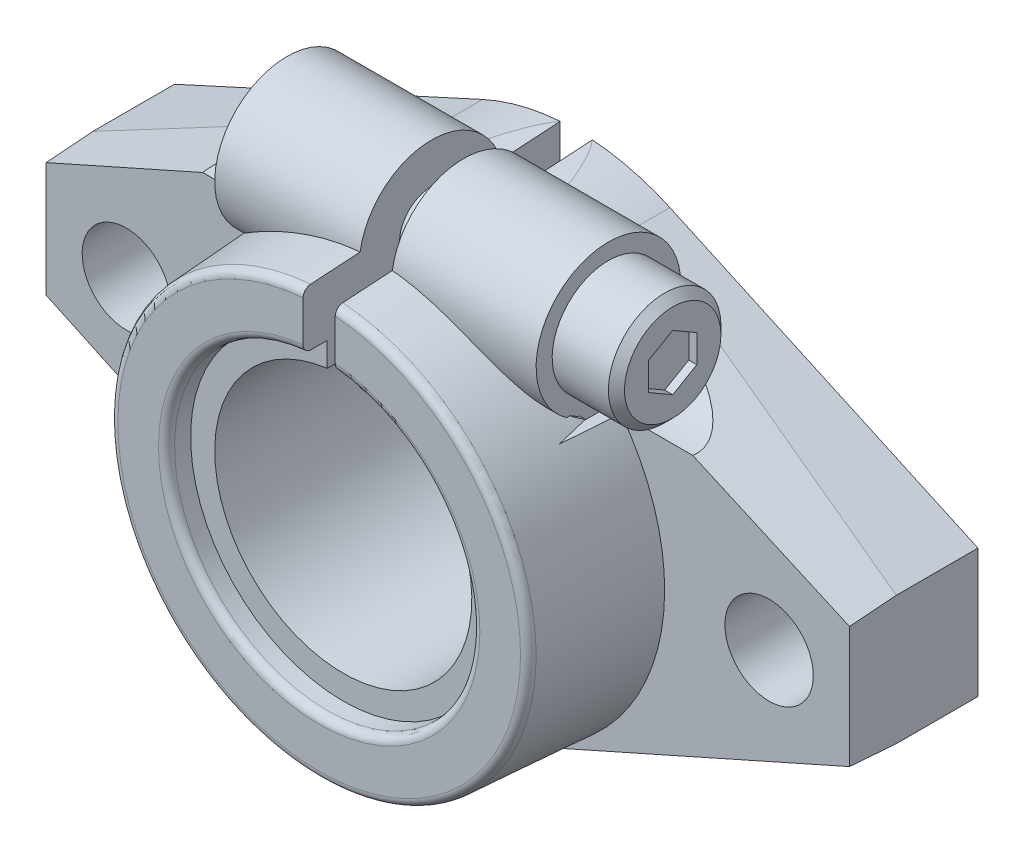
ISO-10303-21;
HEADER;
FILE_DESCRIPTION(('STEP AP214'),'2;1');
FILE_NAME('part.step','',(''),(''),'','','');
FILE_SCHEMA(('AUTOMOTIVE_DESIGN { 1 0 10303 214 1 1 1 1 }'));
ENDSEC;
DATA;
#1=APPLICATION_CONTEXT('core data for automotive mechanical design processes');
#2=APPLICATION_PROTOCOL_DEFINITION('international standard','automotive_design',2000,#1);
#3=PRODUCT_CONTEXT('',#1,'mechanical');
#4=PRODUCT('Part','Part','',(#3));
#5=PRODUCT_RELATED_PRODUCT_CATEGORY('part','',(#4));
#6=PRODUCT_DEFINITION_FORMATION('','',#4);
#7=PRODUCT_DEFINITION_CONTEXT('part definition',#1,'design');
#8=PRODUCT_DEFINITION('design','',#6,#7);
#9=PRODUCT_DEFINITION_SHAPE('','',#8);
#10=(LENGTH_UNIT() NAMED_UNIT(*) SI_UNIT(.MILLI.,.METRE.));
#11=(NAMED_UNIT(*) PLANE_ANGLE_UNIT() SI_UNIT($,.RADIAN.));
#12=(NAMED_UNIT(*) SI_UNIT($,.STERADIAN.) SOLID_ANGLE_UNIT());
#13=UNCERTAINTY_MEASURE_WITH_UNIT(LENGTH_MEASURE(1.E-05),#10,'distance_accuracy_value','');
#14=(GEOMETRIC_REPRESENTATION_CONTEXT(3) GLOBAL_UNCERTAINTY_ASSIGNED_CONTEXT((#13)) GLOBAL_UNIT_ASSIGNED_CONTEXT((#10,
#11,#12)) REPRESENTATION_CONTEXT('',''));
#15=CARTESIAN_POINT('',(0.,0.,0.));
#16=DIRECTION('',(0.,0.,1.));
#17=DIRECTION('',(1.,0.,0.));
#18=AXIS2_PLACEMENT_3D('',#15,#16,#17);
#19=CARTESIAN_POINT('',(-5.80974174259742,-12.7393847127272,0.));
#20=DIRECTION('',(-0.414452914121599,-0.910070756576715,0.));
#21=DIRECTION('',(-0.910070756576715,0.414452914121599,0.));
#22=AXIS2_PLACEMENT_3D('',#19,#20,#21);
#23=PLANE('',#22);
#24=DIRECTION('',(-0.907640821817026,0.413346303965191,-0.0730271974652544));
#25=VECTOR('',#24,1.);
#26=CARTESIAN_POINT('',(-16.4249078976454,-7.90515999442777,3.98683479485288));
#27=LINE('',#26,#25);
#28=CARTESIAN_POINT('',(-5.80974174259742,-12.7393847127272,4.84091254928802));
#29=VERTEX_POINT('',#28);
#30=CARTESIAN_POINT('',(-25.,-4.,3.29689784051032));
#31=VERTEX_POINT('',#30);
#32=EDGE_CURVE('E852',#29,#31,#27,.T.);
#33=ORIENTED_EDGE('',*,*,#32,.T.);
#34=DIRECTION('',(0.,0.,1.));
#35=VECTOR('',#34,1.);
#36=CARTESIAN_POINT('',(-25.,-4.,0.));
#37=LINE('',#36,#35);
#38=CARTESIAN_POINT('',(-25.,-4.,0.));
#39=VERTEX_POINT('',#38);
#40=EDGE_CURVE('E864',#39,#31,#37,.T.);
#41=ORIENTED_EDGE('',*,*,#40,.F.);
#42=DIRECTION('',(0.910070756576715,-0.414452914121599,0.));
#43=VECTOR('',#42,1.);
#44=CARTESIAN_POINT('',(-25.,-4.,0.));
#45=LINE('',#44,#43);
#46=CARTESIAN_POINT('',(-5.80974174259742,-12.7393847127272,0.));
#47=VERTEX_POINT('',#46);
#48=EDGE_CURVE('E609',#39,#47,#45,.T.);
#49=ORIENTED_EDGE('',*,*,#48,.T.);
#50=DIRECTION('',(0.,0.,1.));
#51=VECTOR('',#50,1.);
#52=CARTESIAN_POINT('',(-5.80974174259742,-12.7393847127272,0.));
#53=LINE('',#52,#51);
#54=EDGE_CURVE('E591',#47,#29,#53,.T.);
#55=ORIENTED_EDGE('',*,*,#54,.T.);
#56=EDGE_LOOP('',(#33,#41,#49,#55));
#57=FACE_BOUND('',#56,.T.);
#58=ADVANCED_FACE('F55',(#57),#23,.T.);
#59=CARTESIAN_POINT('',(25.,-4.,0.));
#60=DIRECTION('',(0.414452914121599,-0.910070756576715,0.));
#61=DIRECTION('',(0.,0.,-1.));
#62=AXIS2_PLACEMENT_3D('',#59,#60,#61);
#63=PLANE('',#62);
#64=DIRECTION('',(-0.903478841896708,-0.411450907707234,-0.120142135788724));
#65=VECTOR('',#64,1.);
#66=CARTESIAN_POINT('',(25.1915062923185,-3.91278662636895,5.11057928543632));
#67=LINE('',#66,#65);
#68=CARTESIAN_POINT('',(25.,-4.,5.0851133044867));
#69=VERTEX_POINT('',#68);
#70=CARTESIAN_POINT('',(5.80974174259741,-12.7393847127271,2.53324545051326));
#71=VERTEX_POINT('',#70);
#72=EDGE_CURVE('E572',#69,#71,#67,.T.);
#73=ORIENTED_EDGE('',*,*,#72,.T.);
#74=DIRECTION('',(0.,0.,1.));
#75=VECTOR('',#74,1.);
#76=CARTESIAN_POINT('',(5.80974174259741,-12.7393847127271,0.));
#77=LINE('',#76,#75);
#78=CARTESIAN_POINT('',(5.80974174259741,-12.7393847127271,0.));
#79=VERTEX_POINT('',#78);
#80=EDGE_CURVE('E731',#79,#71,#77,.T.);
#81=ORIENTED_EDGE('',*,*,#80,.F.);
#82=DIRECTION('',(0.910070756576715,0.414452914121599,0.));
#83=VECTOR('',#82,1.);
#84=CARTESIAN_POINT('',(5.80974174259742,-12.7393847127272,0.));
#85=LINE('',#84,#83);
#86=CARTESIAN_POINT('',(25.,-4.,0.));
#87=VERTEX_POINT('',#86);
#88=EDGE_CURVE('E613',#79,#87,#85,.T.);
#89=ORIENTED_EDGE('',*,*,#88,.T.);
#90=DIRECTION('',(0.,0.,1.));
#91=VECTOR('',#90,1.);
#92=CARTESIAN_POINT('',(25.,-4.,0.));
#93=LINE('',#92,#91);
#94=EDGE_CURVE('E520',#87,#69,#93,.T.);
#95=ORIENTED_EDGE('',*,*,#94,.T.);
#96=EDGE_LOOP('',(#73,#81,#89,#95));
#97=FACE_BOUND('',#96,.T.);
#98=ADVANCED_FACE('F1246',(#97),#63,.T.);
#99=CARTESIAN_POINT('',(0.,0.0178571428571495,0.));
#100=DIRECTION('',(0.,0.,-1.));
#101=DIRECTION('',(0.415854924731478,0.909430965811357,0.));
#102=AXIS2_PLACEMENT_3D('',#99,#100,#101);
#103=CYLINDRICAL_SURFACE('',#102,14.0178571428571);
#104=CARTESIAN_POINT('',(-4.07470870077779,13.4304284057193,3.59723916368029));
#105=CARTESIAN_POINT('',(-4.01889500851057,13.4473844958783,3.60082117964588));
#106=CARTESIAN_POINT('',(-3.96297631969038,13.4639919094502,3.60441762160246));
#107=CARTESIAN_POINT('',(-3.85093599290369,13.4965074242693,3.61163561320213));
#108=CARTESIAN_POINT('',(-3.79481434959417,13.5124155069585,3.61525716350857));
#109=CARTESIAN_POINT('',(-3.68237661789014,13.5435299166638,3.62252153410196));
#110=CARTESIAN_POINT('',(-3.62606052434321,13.558736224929,3.62616435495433));
#111=CARTESIAN_POINT('',(-3.51324384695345,13.5884444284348,3.63349045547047));
#112=CARTESIAN_POINT('',(-3.45674325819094,13.6029463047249,3.63717373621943));
#113=CARTESIAN_POINT('',(-3.34377505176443,13.6311912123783,3.64449402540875));
#114=CARTESIAN_POINT('',(-3.28730810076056,13.6449368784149,3.64813115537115));
#115=CARTESIAN_POINT('',(-3.17407744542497,13.6717556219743,3.65530890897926));
#116=CARTESIAN_POINT('',(-3.11731336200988,13.684827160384,3.65884930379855));
#117=CARTESIAN_POINT('',(-3.00349729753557,13.7102904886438,3.66585267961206));
#118=CARTESIAN_POINT('',(-2.94644495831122,13.7226807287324,3.66931547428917));
#119=CARTESIAN_POINT('',(-2.83205998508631,13.7467747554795,3.67615982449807));
#120=CARTESIAN_POINT('',(-2.7747270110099,13.7584769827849,3.67954118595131));
#121=CARTESIAN_POINT('',(-2.71732040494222,13.7698202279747,3.68287635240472));
#122=B_SPLINE_CURVE_WITH_KNOTS('',3,(#104,#105,#106,#107,#108,#109,#110,#111,#112,#113,#114,
#115,#116,#117,#118,#119,#120,#121),.UNSPECIFIED.,.F.,.F.,(4,2,2,2,2,2,2,2,4),(0.,
0.175325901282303,0.350656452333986,0.525991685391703,0.701331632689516,0.876015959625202,
1.05108289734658,1.22653285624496,1.4023662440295),.UNSPECIFIED.);
#123=CARTESIAN_POINT('',(-4.07470870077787,13.4304284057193,3.59723916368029));
#124=VERTEX_POINT('',#123);
#125=CARTESIAN_POINT('',(-2.71732040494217,13.7698202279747,3.68287635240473));
#126=VERTEX_POINT('',#125);
#127=EDGE_CURVE('E1044',#124,#126,#122,.T.);
#128=ORIENTED_EDGE('',*,*,#127,.T.);
#129=CARTESIAN_POINT('',(0.,0.0178571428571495,223.714285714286));
#130=DIRECTION('',(0.,-0.998052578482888,-0.0623782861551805));
#131=DIRECTION('',(0.,0.0623782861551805,-0.998052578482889));
#132=AXIS2_PLACEMENT_3D('',#129,#130,#131);
#133=ELLIPSE('',#132,224.723345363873,14.0178571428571);
#134=CARTESIAN_POINT('',(-1.0000000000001,14.,0.));
#135=VERTEX_POINT('',#134);
#136=EDGE_CURVE('E694',#126,#135,#133,.T.);
#137=ORIENTED_EDGE('',*,*,#136,.T.);
#138=CARTESIAN_POINT('',(0.,0.0178571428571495,0.));
#139=DIRECTION('',(0.,0.,1.));
#140=DIRECTION('',(0.415854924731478,0.909430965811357,0.));
#141=AXIS2_PLACEMENT_3D('',#138,#139,#140);
#142=CIRCLE('',#141,14.0178571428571);
#143=CARTESIAN_POINT('',(-5.82939492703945,12.7661305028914,0.));
#144=VERTEX_POINT('',#143);
#145=EDGE_CURVE('E845',#135,#144,#142,.T.);
#146=ORIENTED_EDGE('',*,*,#145,.T.);
#147=DIRECTION('',(0.,0.,1.));
#148=VECTOR('',#147,1.);
#149=CARTESIAN_POINT('',(-5.82939492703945,12.7661305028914,0.));
#150=LINE('',#149,#148);
#151=CARTESIAN_POINT('',(-5.82939492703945,12.7661305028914,2.06951538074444));
#152=VERTEX_POINT('',#151);
#153=EDGE_CURVE('E873',#144,#152,#150,.T.);
#154=ORIENTED_EDGE('',*,*,#153,.T.);
#155=CARTESIAN_POINT('',(0.,0.0178571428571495,202.524181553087));
#156=DIRECTION('',(0.40574585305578,-0.911320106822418,-0.0697564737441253));
#157=DIRECTION('',(-0.0283725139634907,0.063725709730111,-0.997564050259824));
#158=AXIS2_PLACEMENT_3D('',#155,#156,#157);
#159=ELLIPSE('',#158,200.954210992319,14.0178571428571);
#160=EDGE_CURVE('E523',#152,#124,#159,.T.);
#161=ORIENTED_EDGE('',*,*,#160,.T.);
#162=EDGE_LOOP('',(#128,#137,#146,#154,#161));
#163=FACE_BOUND('',#162,.T.);
#164=ADVANCED_FACE('F1236',(#163),#103,.T.);
#165=CARTESIAN_POINT('',(-25.,4.,0.));
#166=DIRECTION('',(-0.415854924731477,0.909430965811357,0.));
#167=DIRECTION('',(0.,0.,1.));
#168=AXIS2_PLACEMENT_3D('',#165,#166,#167);
#169=PLANE('',#168);
#170=DIRECTION('',(0.900265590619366,0.411663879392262,-0.141614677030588));
#171=VECTOR('',#170,1.);
#172=CARTESIAN_POINT('',(-25.092908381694,3.95751584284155,5.09972809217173));
#173=LINE('',#172,#171);
#174=CARTESIAN_POINT('',(-25.,4.,5.0851133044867));
#175=VERTEX_POINT('',#174);
#176=EDGE_CURVE('E869',#175,#152,#173,.T.);
#177=ORIENTED_EDGE('',*,*,#176,.T.);
#178=ORIENTED_EDGE('',*,*,#153,.F.);
#179=DIRECTION('',(-0.909430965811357,-0.415854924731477,0.));
#180=VECTOR('',#179,1.);
#181=CARTESIAN_POINT('',(-5.82939492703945,12.7661305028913,0.));
#182=LINE('',#181,#180);
#183=CARTESIAN_POINT('',(-25.,4.,0.));
#184=VERTEX_POINT('',#183);
#185=EDGE_CURVE('E841',#144,#184,#182,.T.);
#186=ORIENTED_EDGE('',*,*,#185,.T.);
#187=DIRECTION('',(0.,0.,1.));
#188=VECTOR('',#187,1.);
#189=CARTESIAN_POINT('',(-25.,4.,0.));
#190=LINE('',#189,#188);
#191=EDGE_CURVE('E860',#184,#175,#190,.T.);
#192=ORIENTED_EDGE('',*,*,#191,.T.);
#193=EDGE_LOOP('',(#177,#178,#186,#192));
#194=FACE_BOUND('',#193,.T.);
#195=ADVANCED_FACE('F1245',(#194),#169,.T.);
#196=CARTESIAN_POINT('',(-26.6229834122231,3.64528042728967,0.279025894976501));
#197=DIRECTION('',(-0.40574585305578,0.911320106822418,0.0697564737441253));
#198=DIRECTION('',(0.169435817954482,0.,0.985541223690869));
#199=AXIS2_PLACEMENT_3D('',#196,#197,#198);
#200=PLANE('',#199);
#201=CARTESIAN_POINT('',(-5.40755545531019,12.5,8.));
#202=DIRECTION('',(0.40574585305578,-0.911320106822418,-0.0697564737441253));
#203=DIRECTION('',(0.913985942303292,0.404562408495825,0.0309669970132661));
#204=AXIS2_PLACEMENT_3D('',#201,#202,#203);
#205=ELLIPSE('',#204,11.0906863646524,4.5);
#206=CARTESIAN_POINT('',(-10.,10.7733984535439,3.84441976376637));
#207=VERTEX_POINT('',#206);
#208=EDGE_CURVE('E1039',#207,#124,#205,.T.);
#209=ORIENTED_EDGE('',*,*,#208,.T.);
#210=ORIENTED_EDGE('',*,*,#160,.F.);
#211=ORIENTED_EDGE('',*,*,#176,.F.);
#212=DIRECTION('',(0.,0.0763211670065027,-0.997083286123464));
#213=VECTOR('',#212,1.);
#214=CARTESIAN_POINT('',(-25.,4.35202027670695,0.486211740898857));
#215=LINE('',#214,#213);
#216=CARTESIAN_POINT('',(-25.,3.77688167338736,8.));
#217=VERTEX_POINT('',#216);
#218=EDGE_CURVE('E856',#217,#175,#215,.T.);
#219=ORIENTED_EDGE('',*,*,#218,.F.);
#220=DIRECTION('',(-0.913545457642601,-0.4067366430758,0.));
#221=VECTOR('',#220,1.);
#222=CARTESIAN_POINT('',(-15.9713187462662,7.79670955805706,8.));
#223=LINE('',#222,#221);
#224=CARTESIAN_POINT('',(-15.2451965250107,8.12,8.));
#225=VERTEX_POINT('',#224);
#226=EDGE_CURVE('E710',#225,#217,#223,.T.);
#227=ORIENTED_EDGE('',*,*,#226,.F.);
#228=CARTESIAN_POINT('',(-5.40755545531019,12.5,8.));
#229=DIRECTION('',(0.40574585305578,-0.911320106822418,-0.0697564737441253));
#230=DIRECTION('',(0.913985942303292,0.404562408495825,0.030966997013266));
#231=AXIS2_PLACEMENT_3D('',#228,#229,#230);
#232=ELLIPSE('',#231,10.7949347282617,4.38);
#233=CARTESIAN_POINT('',(-10.,10.7630884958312,3.97911223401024));
#234=VERTEX_POINT('',#233);
#235=EDGE_CURVE('E507',#225,#234,#232,.T.);
#236=ORIENTED_EDGE('',*,*,#235,.T.);
#237=DIRECTION('',(0.,0.0763211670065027,-0.997083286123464));
#238=VECTOR('',#237,1.);
#239=CARTESIAN_POINT('',(-10.,10.74176362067,4.25770698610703));
#240=LINE('',#239,#238);
#241=EDGE_CURVE('E542',#234,#207,#240,.T.);
#242=ORIENTED_EDGE('',*,*,#241,.T.);
#243=EDGE_LOOP('',(#209,#210,#211,#219,#227,#236,#242));
#244=FACE_BOUND('',#243,.T.);
#245=ADVANCED_FACE('F1247',(#244),#200,.T.);
#246=CARTESIAN_POINT('',(25.,4.,0.));
#247=DIRECTION('',(1.,0.,0.));
#248=DIRECTION('',(0.,1.,0.));
#249=AXIS2_PLACEMENT_3D('',#246,#247,#248);
#250=PLANE('',#249);
#251=DIRECTION('',(0.,-0.0763211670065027,-0.997083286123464));
#252=VECTOR('',#251,1.);
#253=CARTESIAN_POINT('',(25.,-4.35202027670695,0.486211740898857));
#254=LINE('',#253,#252);
#255=CARTESIAN_POINT('',(25.,-3.77688167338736,8.));
#256=VERTEX_POINT('',#255);
#257=EDGE_CURVE('E567',#256,#69,#254,.T.);
#258=ORIENTED_EDGE('',*,*,#257,.T.);
#259=ORIENTED_EDGE('',*,*,#94,.F.);
#260=DIRECTION('',(0.,1.,0.));
#261=VECTOR('',#260,1.);
#262=CARTESIAN_POINT('',(25.,-4.,0.));
#263=LINE('',#262,#261);
#264=CARTESIAN_POINT('',(25.,4.,0.));
#265=VERTEX_POINT('',#264);
#266=EDGE_CURVE('E831',#87,#265,#263,.T.);
#267=ORIENTED_EDGE('',*,*,#266,.T.);
#268=DIRECTION('',(0.,0.,1.));
#269=VECTOR('',#268,1.);
#270=CARTESIAN_POINT('',(25.,4.,0.));
#271=LINE('',#270,#269);
#272=CARTESIAN_POINT('',(25.,4.,5.0851133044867));
#273=VERTEX_POINT('',#272);
#274=EDGE_CURVE('E524',#265,#273,#271,.T.);
#275=ORIENTED_EDGE('',*,*,#274,.T.);
#276=DIRECTION('',(0.,-0.0763211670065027,0.997083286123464));
#277=VECTOR('',#276,1.);
#278=CARTESIAN_POINT('',(25.,4.37531995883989,0.181817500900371));
#279=LINE('',#278,#277);
#280=CARTESIAN_POINT('',(25.,3.77688167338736,8.));
#281=VERTEX_POINT('',#280);
#282=EDGE_CURVE('E477',#273,#281,#279,.T.);
#283=ORIENTED_EDGE('',*,*,#282,.T.);
#284=DIRECTION('',(0.,-1.,0.));
#285=VECTOR('',#284,1.);
#286=CARTESIAN_POINT('',(25.,-4.,8.));
#287=LINE('',#286,#285);
#288=EDGE_CURVE('E472',#281,#256,#287,.T.);
#289=ORIENTED_EDGE('',*,*,#288,.T.);
#290=EDGE_LOOP('',(#258,#259,#267,#275,#283,#289));
#291=FACE_BOUND('',#290,.T.);
#292=ADVANCED_FACE('F1199',(#291),#250,.T.);
#293=CARTESIAN_POINT('',(5.82939492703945,12.7661305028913,0.));
#294=DIRECTION('',(0.415854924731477,0.909430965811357,0.));
#295=DIRECTION('',(0.,0.,-1.));
#296=AXIS2_PLACEMENT_3D('',#293,#294,#295);
#297=PLANE('',#296);
#298=DIRECTION('',(0.900265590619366,-0.411663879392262,0.141614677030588));
#299=VECTOR('',#298,1.);
#300=CARTESIAN_POINT('',(15.6998363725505,8.25267996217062,3.62216761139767));
#301=LINE('',#300,#299);
#302=CARTESIAN_POINT('',(5.82939492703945,12.7661305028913,2.06951538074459));
#303=VERTEX_POINT('',#302);
#304=EDGE_CURVE('E653',#303,#273,#301,.T.);
#305=ORIENTED_EDGE('',*,*,#304,.T.);
#306=ORIENTED_EDGE('',*,*,#274,.F.);
#307=DIRECTION('',(-0.909430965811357,0.415854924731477,0.));
#308=VECTOR('',#307,1.);
#309=CARTESIAN_POINT('',(25.,4.,0.));
#310=LINE('',#309,#308);
#311=CARTESIAN_POINT('',(5.82939492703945,12.7661305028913,0.));
#312=VERTEX_POINT('',#311);
#313=EDGE_CURVE('E791',#265,#312,#310,.T.);
#314=ORIENTED_EDGE('',*,*,#313,.T.);
#315=DIRECTION('',(0.,0.,1.));
#316=VECTOR('',#315,1.);
#317=CARTESIAN_POINT('',(5.82939492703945,12.7661305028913,0.));
#318=LINE('',#317,#316);
#319=EDGE_CURVE('E699',#312,#303,#318,.T.);
#320=ORIENTED_EDGE('',*,*,#319,.T.);
#321=EDGE_LOOP('',(#305,#306,#314,#320));
#322=FACE_BOUND('',#321,.T.);
#323=ADVANCED_FACE('F1203',(#322),#297,.T.);
#324=CARTESIAN_POINT('',(-25.,-4.,0.));
#325=DIRECTION('',(-1.,0.,0.));
#326=DIRECTION('',(0.,0.,1.));
#327=AXIS2_PLACEMENT_3D('',#324,#325,#326);
#328=PLANE('',#327);
#329=DIRECTION('',(0.,0.134251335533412,0.990947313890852));
#330=VECTOR('',#329,1.);
#331=CARTESIAN_POINT('',(-25.,-4.4025592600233,0.325493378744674));
#332=LINE('',#331,#330);
#333=CARTESIAN_POINT('',(-25.,-3.36283419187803,8.));
#334=VERTEX_POINT('',#333);
#335=EDGE_CURVE('E849',#31,#334,#332,.T.);
#336=ORIENTED_EDGE('',*,*,#335,.T.);
#337=DIRECTION('',(0.,1.,0.));
#338=VECTOR('',#337,1.);
#339=CARTESIAN_POINT('',(-25.,4.,8.));
#340=LINE('',#339,#338);
#341=EDGE_CURVE('E714',#334,#217,#340,.T.);
#342=ORIENTED_EDGE('',*,*,#341,.T.);
#343=ORIENTED_EDGE('',*,*,#218,.T.);
#344=ORIENTED_EDGE('',*,*,#191,.F.);
#345=DIRECTION('',(0.,-1.,0.));
#346=VECTOR('',#345,1.);
#347=CARTESIAN_POINT('',(-25.,4.,0.));
#348=LINE('',#347,#346);
#349=EDGE_CURVE('E612',#184,#39,#348,.T.);
#350=ORIENTED_EDGE('',*,*,#349,.T.);
#351=ORIENTED_EDGE('',*,*,#40,.T.);
#352=EDGE_LOOP('',(#336,#342,#343,#344,#350,#351));
#353=FACE_BOUND('',#352,.T.);
#354=ADVANCED_FACE('F1253',(#353),#328,.T.);
#355=CARTESIAN_POINT('',(-26.6778725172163,-3.59820922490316,0.48747737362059));
#356=DIRECTION('',(-0.419468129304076,-0.89955230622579,0.121869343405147));
#357=DIRECTION('',(-0.90630778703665,0.422618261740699,0.));
#358=AXIS2_PLACEMENT_3D('',#355,#356,#357);
#359=PLANE('',#358);
#360=DIRECTION('',(0.154325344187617,0.0616309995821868,0.986095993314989));
#361=VECTOR('',#360,1.);
#362=CARTESIAN_POINT('',(-4.5768950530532,-14.0256014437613,-0.409623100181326));
#363=LINE('',#362,#361);
#364=CARTESIAN_POINT('',(-3.43966654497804,-13.5714405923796,6.85695052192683));
#365=VERTEX_POINT('',#364);
#366=CARTESIAN_POINT('',(-3.26077777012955,-13.5,8.));
#367=VERTEX_POINT('',#366);
#368=EDGE_CURVE('E631',#365,#367,#363,.T.);
#369=ORIENTED_EDGE('',*,*,#368,.T.);
#370=DIRECTION('',(0.90630778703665,-0.422618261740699,0.));
#371=VECTOR('',#370,1.);
#372=CARTESIAN_POINT('',(-16.0206176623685,-7.54998894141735,8.));
#373=LINE('',#372,#371);
#374=EDGE_CURVE('E776',#334,#367,#373,.T.);
#375=ORIENTED_EDGE('',*,*,#374,.F.);
#376=ORIENTED_EDGE('',*,*,#335,.F.);
#377=ORIENTED_EDGE('',*,*,#32,.F.);
#378=CARTESIAN_POINT('',(0.,0.0178571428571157,119.002583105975));
#379=DIRECTION('',(0.419468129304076,0.89955230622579,-0.121869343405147));
#380=DIRECTION('',(-0.0515042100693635,-0.110451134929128,-0.992546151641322));
#381=AXIS2_PLACEMENT_3D('',#378,#379,#380);
#382=ELLIPSE('',#381,115.023653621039,14.0178571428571);
#383=EDGE_CURVE('E571',#365,#29,#382,.T.);
#384=ORIENTED_EDGE('',*,*,#383,.F.);
#385=EDGE_LOOP('',(#369,#375,#376,#377,#384));
#386=FACE_BOUND('',#385,.T.);
#387=ADVANCED_FACE('F1259',(#386),#359,.T.);
#388=CARTESIAN_POINT('',(0.,0.,0.));
#389=DIRECTION('',(0.,0.,1.));
#390=DIRECTION('',(1.,0.,0.));
#391=AXIS2_PLACEMENT_3D('',#388,#389,#390);
#392=PLANE('',#391);
#393=CARTESIAN_POINT('',(-20.,0.,0.));
#394=DIRECTION('',(0.,0.,1.));
#395=DIRECTION('',(0.,1.,0.));
#396=AXIS2_PLACEMENT_3D('',#393,#394,#395);
#397=CIRCLE('',#396,2.75);
#398=CARTESIAN_POINT('',(-20.,-2.75,0.));
#399=VERTEX_POINT('',#398);
#400=EDGE_CURVE('E515',#399,#399,#397,.T.);
#401=ORIENTED_EDGE('',*,*,#400,.T.);
#402=EDGE_LOOP('',(#401));
#403=FACE_BOUND('',#402,.T.);
#404=CARTESIAN_POINT('',(20.,0.,0.));
#405=DIRECTION('',(0.,0.,1.));
#406=DIRECTION('',(0.,1.,0.));
#407=AXIS2_PLACEMENT_3D('',#404,#405,#406);
#408=CIRCLE('',#407,2.75);
#409=CARTESIAN_POINT('',(20.,-2.75,0.));
#410=VERTEX_POINT('',#409);
#411=EDGE_CURVE('E635',#410,#410,#408,.T.);
#412=ORIENTED_EDGE('',*,*,#411,.T.);
#413=EDGE_LOOP('',(#412));
#414=FACE_BOUND('',#413,.T.);
#415=DIRECTION('',(0.,-1.,0.));
#416=VECTOR('',#415,1.);
#417=CARTESIAN_POINT('',(-1.,0.,0.));
#418=LINE('',#417,#416);
#419=CARTESIAN_POINT('',(-1.,8.44097150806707,0.));
#420=VERTEX_POINT('',#419);
#421=EDGE_CURVE('E722',#135,#420,#418,.T.);
#422=ORIENTED_EDGE('',*,*,#421,.T.);
#423=CARTESIAN_POINT('',(0.,0.,0.));
#424=DIRECTION('',(0.,0.,1.));
#425=DIRECTION('',(1.,0.,0.));
#426=AXIS2_PLACEMENT_3D('',#423,#424,#425);
#427=CIRCLE('',#426,8.5);
#428=CARTESIAN_POINT('',(1.,8.44097150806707,0.));
#429=VERTEX_POINT('',#428);
#430=EDGE_CURVE('E876',#420,#429,#427,.T.);
#431=ORIENTED_EDGE('',*,*,#430,.T.);
#432=DIRECTION('',(0.,1.,0.));
#433=VECTOR('',#432,1.);
#434=CARTESIAN_POINT('',(1.,10.,0.));
#435=LINE('',#434,#433);
#436=CARTESIAN_POINT('',(1.00000000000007,14.,0.));
#437=VERTEX_POINT('',#436);
#438=EDGE_CURVE('E649',#429,#437,#435,.T.);
#439=ORIENTED_EDGE('',*,*,#438,.T.);
#440=CARTESIAN_POINT('',(0.,0.0178571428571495,0.));
#441=DIRECTION('',(0.,0.,1.));
#442=DIRECTION('',(0.415854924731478,0.909430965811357,0.));
#443=AXIS2_PLACEMENT_3D('',#440,#441,#442);
#444=CIRCLE('',#443,14.0178571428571);
#445=EDGE_CURVE('E478',#312,#437,#444,.T.);
#446=ORIENTED_EDGE('',*,*,#445,.F.);
#447=ORIENTED_EDGE('',*,*,#313,.F.);
#448=ORIENTED_EDGE('',*,*,#266,.F.);
#449=ORIENTED_EDGE('',*,*,#88,.F.);
#450=CARTESIAN_POINT('',(0.,0.0178571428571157,0.));
#451=DIRECTION('',(0.,0.,1.));
#452=DIRECTION('',(-0.414452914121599,-0.910070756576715,0.));
#453=AXIS2_PLACEMENT_3D('',#450,#451,#452);
#454=CIRCLE('',#453,14.0178571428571);
#455=CARTESIAN_POINT('',(0.,-14.,0.));
#456=VERTEX_POINT('',#455);
#457=EDGE_CURVE('E698',#456,#79,#454,.T.);
#458=ORIENTED_EDGE('',*,*,#457,.F.);
#459=CARTESIAN_POINT('',(0.,0.0178571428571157,0.));
#460=DIRECTION('',(0.,0.,1.));
#461=DIRECTION('',(-0.414452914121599,-0.910070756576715,0.));
#462=AXIS2_PLACEMENT_3D('',#459,#460,#461);
#463=CIRCLE('',#462,14.0178571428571);
#464=EDGE_CURVE('E595',#47,#456,#463,.T.);
#465=ORIENTED_EDGE('',*,*,#464,.F.);
#466=ORIENTED_EDGE('',*,*,#48,.F.);
#467=ORIENTED_EDGE('',*,*,#349,.F.);
#468=ORIENTED_EDGE('',*,*,#185,.F.);
#469=ORIENTED_EDGE('',*,*,#145,.F.);
#470=EDGE_LOOP('',(#422,#431,#439,#446,#447,#448,#449,#458,#465,#466,#467,#468,#469));
#471=FACE_BOUND('',#470,.T.);
#472=ADVANCED_FACE('F1261',(#403,#414,#471),#392,.F.);
#473=CARTESIAN_POINT('',(0.,0.0178571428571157,0.));
#474=DIRECTION('',(0.,0.,-1.));
#475=DIRECTION('',(-0.414452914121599,-0.910070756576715,0.));
#476=AXIS2_PLACEMENT_3D('',#473,#474,#475);
#477=CYLINDRICAL_SURFACE('',#476,14.0178571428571);
#478=CARTESIAN_POINT('',(0.,0.0178571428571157,224.285714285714));
#479=DIRECTION('',(0.,0.998052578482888,-0.0623782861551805));
#480=DIRECTION('',(0.,-0.0623782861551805,-0.998052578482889));
#481=AXIS2_PLACEMENT_3D('',#478,#479,#480);
#482=ELLIPSE('',#481,224.723345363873,14.0178571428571);
#483=CARTESIAN_POINT('',(3.22418875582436,-13.6241707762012,6.0132675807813));
#484=VERTEX_POINT('',#483);
#485=EDGE_CURVE('E670',#484,#456,#482,.T.);
#486=ORIENTED_EDGE('',*,*,#485,.T.);
#487=ORIENTED_EDGE('',*,*,#457,.T.);
#488=ORIENTED_EDGE('',*,*,#80,.T.);
#489=CARTESIAN_POINT('',(0.,0.0178571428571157,202.990764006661));
#490=DIRECTION('',(-0.40574585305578,0.911320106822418,-0.0697564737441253));
#491=DIRECTION('',(0.0283725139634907,-0.063725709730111,-0.997564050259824));
#492=AXIS2_PLACEMENT_3D('',#489,#490,#491);
#493=ELLIPSE('',#492,200.954210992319,14.0178571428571);
#494=EDGE_CURVE('E628',#71,#484,#493,.T.);
#495=ORIENTED_EDGE('',*,*,#494,.T.);
#496=EDGE_LOOP('',(#486,#487,#488,#495));
#497=FACE_BOUND('',#496,.T.);
#498=ADVANCED_FACE('F1264',(#497),#477,.T.);
#499=CARTESIAN_POINT('',(0.,0.0178571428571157,0.));
#500=DIRECTION('',(0.,0.,-1.));
#501=DIRECTION('',(-0.414452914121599,-0.910070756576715,0.));
#502=AXIS2_PLACEMENT_3D('',#499,#500,#501);
#503=CYLINDRICAL_SURFACE('',#502,14.0178571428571);
#504=CARTESIAN_POINT('',(0.,0.0178571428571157,224.285714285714));
#505=DIRECTION('',(0.,0.998052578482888,-0.0623782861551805));
#506=DIRECTION('',(0.,-0.0623782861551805,-0.998052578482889));
#507=AXIS2_PLACEMENT_3D('',#504,#505,#506);
#508=ELLIPSE('',#507,224.723345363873,14.0178571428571);
#509=EDGE_CURVE('E601',#456,#365,#508,.T.);
#510=ORIENTED_EDGE('',*,*,#509,.T.);
#511=ORIENTED_EDGE('',*,*,#383,.T.);
#512=ORIENTED_EDGE('',*,*,#54,.F.);
#513=ORIENTED_EDGE('',*,*,#464,.T.);
#514=EDGE_LOOP('',(#510,#511,#512,#513));
#515=FACE_BOUND('',#514,.T.);
#516=ADVANCED_FACE('F1268',(#515),#503,.T.);
#517=CARTESIAN_POINT('',(26.6229834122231,-3.64528042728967,0.279025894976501));
#518=DIRECTION('',(-0.40574585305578,0.911320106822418,-0.0697564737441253));
#519=DIRECTION('',(-0.169435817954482,0.,0.985541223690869));
#520=AXIS2_PLACEMENT_3D('',#517,#518,#519);
#521=PLANE('',#520);
#522=DIRECTION('',(0.0314672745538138,-0.0623473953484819,-0.99755832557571));
#523=VECTOR('',#522,1.);
#524=CARTESIAN_POINT('',(3.41161218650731,-13.9955204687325,0.0716725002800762));
#525=LINE('',#524,#523);
#526=CARTESIAN_POINT('',(3.16151868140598,-13.5,8.));
#527=VERTEX_POINT('',#526);
#528=EDGE_CURVE('E666',#527,#484,#525,.T.);
#529=ORIENTED_EDGE('',*,*,#528,.T.);
#530=ORIENTED_EDGE('',*,*,#494,.F.);
#531=ORIENTED_EDGE('',*,*,#72,.F.);
#532=ORIENTED_EDGE('',*,*,#257,.F.);
#533=DIRECTION('',(0.913545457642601,0.4067366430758,0.));
#534=VECTOR('',#533,1.);
#535=CARTESIAN_POINT('',(15.9713187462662,-7.79670955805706,8.));
#536=LINE('',#535,#534);
#537=EDGE_CURVE('E602',#527,#256,#536,.T.);
#538=ORIENTED_EDGE('',*,*,#537,.F.);
#539=EDGE_LOOP('',(#529,#530,#531,#532,#538));
#540=FACE_BOUND('',#539,.T.);
#541=ADVANCED_FACE('F1196',(#540),#521,.F.);
#542=CARTESIAN_POINT('',(5.,-14.,0.));
#543=DIRECTION('',(0.,0.998052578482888,-0.0623782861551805));
#544=DIRECTION('',(-1.,0.,0.));
#545=AXIS2_PLACEMENT_3D('',#542,#543,#544);
#546=PLANE('',#545);
#547=ORIENTED_EDGE('',*,*,#509,.F.);
#548=ORIENTED_EDGE('',*,*,#485,.F.);
#549=ORIENTED_EDGE('',*,*,#528,.F.);
#550=DIRECTION('',(1.,0.,0.));
#551=VECTOR('',#550,1.);
#552=CARTESIAN_POINT('',(2.5,-13.5,8.));
#553=LINE('',#552,#551);
#554=CARTESIAN_POINT('',(0.,-13.5,8.));
#555=VERTEX_POINT('',#554);
#556=EDGE_CURVE('E735',#555,#527,#553,.T.);
#557=ORIENTED_EDGE('',*,*,#556,.F.);
#558=DIRECTION('',(1.,0.,0.));
#559=VECTOR('',#558,1.);
#560=CARTESIAN_POINT('',(2.5,-13.5,8.));
#561=LINE('',#560,#559);
#562=EDGE_CURVE('E739',#367,#555,#561,.T.);
#563=ORIENTED_EDGE('',*,*,#562,.F.);
#564=ORIENTED_EDGE('',*,*,#368,.F.);
#565=EDGE_LOOP('',(#547,#548,#549,#557,#563,#564));
#566=FACE_BOUND('',#565,.T.);
#567=ADVANCED_FACE('F1192',(#566),#546,.F.);
#568=CARTESIAN_POINT('',(0.,8.75,14.5));
#569=DIRECTION('',(0.,0.,-1.));
#570=DIRECTION('',(0.,-1.,0.));
#571=AXIS2_PLACEMENT_3D('',#568,#569,#570);
#572=PLANE('',#571);
#573=DIRECTION('',(0.,1.,0.));
#574=VECTOR('',#573,1.);
#575=CARTESIAN_POINT('',(-1.,4.375,14.5));
#576=LINE('',#575,#574);
#577=CARTESIAN_POINT('',(-1.,7.93725393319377,14.5));
#578=VERTEX_POINT('',#577);
#579=CARTESIAN_POINT('',(-1.,9.44722181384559,14.5));
#580=VERTEX_POINT('',#579);
#581=EDGE_CURVE('E693',#578,#580,#576,.T.);
#582=ORIENTED_EDGE('',*,*,#581,.T.);
#583=CARTESIAN_POINT('',(0.,0.,14.5));
#584=DIRECTION('',(0.,0.,1.));
#585=DIRECTION('',(0.,1.,0.));
#586=AXIS2_PLACEMENT_3D('',#583,#584,#585);
#587=CIRCLE('',#586,9.5);
#588=CARTESIAN_POINT('',(1.,9.44722181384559,14.5));
#589=VERTEX_POINT('',#588);
#590=EDGE_CURVE('E1811',#580,#589,#587,.T.);
#591=ORIENTED_EDGE('',*,*,#590,.T.);
#592=DIRECTION('',(0.,-1.,0.));
#593=VECTOR('',#592,1.);
#594=CARTESIAN_POINT('',(1.,14.375,14.5));
#595=LINE('',#594,#593);
#596=CARTESIAN_POINT('',(1.,7.93725393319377,14.5));
#597=VERTEX_POINT('',#596);
#598=EDGE_CURVE('E652',#589,#597,#595,.T.);
#599=ORIENTED_EDGE('',*,*,#598,.T.);
#600=CARTESIAN_POINT('',(0.,0.,14.5));
#601=DIRECTION('',(0.,0.,1.));
#602=DIRECTION('',(0.,1.,0.));
#603=AXIS2_PLACEMENT_3D('',#600,#601,#602);
#604=CIRCLE('',#603,8.);
#605=EDGE_CURVE('E1552',#578,#597,#604,.T.);
#606=ORIENTED_EDGE('',*,*,#605,.F.);
#607=EDGE_LOOP('',(#582,#591,#599,#606));
#608=FACE_BOUND('',#607,.T.);
#609=ADVANCED_FACE('F1275',(#608),#572,.F.);
#610=CARTESIAN_POINT('',(0.,0.,8.));
#611=DIRECTION('',(0.,0.,1.));
#612=DIRECTION('',(1.,0.,0.));
#613=AXIS2_PLACEMENT_3D('',#610,#611,#612);
#614=PLANE('',#613);
#615=CARTESIAN_POINT('',(20.,0.,8.));
#616=DIRECTION('',(0.,0.,-1.));
#617=DIRECTION('',(0.,1.,0.));
#618=AXIS2_PLACEMENT_3D('',#615,#616,#617);
#619=CIRCLE('',#618,2.75);
#620=CARTESIAN_POINT('',(20.,-2.75,8.));
#621=VERTEX_POINT('',#620);
#622=EDGE_CURVE('E518',#621,#621,#619,.T.);
#623=ORIENTED_EDGE('',*,*,#622,.T.);
#624=EDGE_LOOP('',(#623));
#625=FACE_BOUND('',#624,.T.);
#626=DIRECTION('',(-1.,0.,0.));
#627=VECTOR('',#626,1.);
#628=CARTESIAN_POINT('',(0.,8.12,8.));
#629=LINE('',#628,#627);
#630=CARTESIAN_POINT('',(15.2451965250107,8.12,8.));
#631=VERTEX_POINT('',#630);
#632=CARTESIAN_POINT('',(10.7849710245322,8.12,8.));
#633=VERTEX_POINT('',#632);
#634=EDGE_CURVE('E469',#631,#633,#629,.T.);
#635=ORIENTED_EDGE('',*,*,#634,.T.);
#636=CARTESIAN_POINT('',(0.,0.,8.));
#637=DIRECTION('',(0.,0.,-1.));
#638=DIRECTION('',(0.,1.,0.));
#639=AXIS2_PLACEMENT_3D('',#636,#637,#638);
#640=CIRCLE('',#639,13.5);
#641=EDGE_CURVE('E706',#633,#555,#640,.T.);
#642=ORIENTED_EDGE('',*,*,#641,.T.);
#643=ORIENTED_EDGE('',*,*,#556,.T.);
#644=ORIENTED_EDGE('',*,*,#537,.T.);
#645=ORIENTED_EDGE('',*,*,#288,.F.);
#646=DIRECTION('',(-0.913545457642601,0.4067366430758,0.));
#647=VECTOR('',#646,1.);
#648=CARTESIAN_POINT('',(15.9713187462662,7.79670955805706,8.));
#649=LINE('',#648,#647);
#650=EDGE_CURVE('E464',#281,#631,#649,.T.);
#651=ORIENTED_EDGE('',*,*,#650,.T.);
#652=EDGE_LOOP('',(#635,#642,#643,#644,#645,#651));
#653=FACE_BOUND('',#652,.T.);
#654=ADVANCED_FACE('F466',(#625,#653),#614,.T.);
#655=CARTESIAN_POINT('',(0.,6.5,16.));
#656=DIRECTION('',(0.,0.,1.));
#657=DIRECTION('',(1.,0.,0.));
#658=AXIS2_PLACEMENT_3D('',#655,#656,#657);
#659=PLANE('',#658);
#660=DIRECTION('',(0.,1.,0.));
#661=VECTOR('',#660,1.);
#662=CARTESIAN_POINT('',(-1.,3.25,16.));
#663=LINE('',#662,#661);
#664=CARTESIAN_POINT('',(-1.,9.9498743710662,16.));
#665=VERTEX_POINT('',#664);
#666=CARTESIAN_POINT('',(-1.,12.4903072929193,16.));
#667=VERTEX_POINT('',#666);
#668=EDGE_CURVE('E690',#665,#667,#663,.T.);
#669=ORIENTED_EDGE('',*,*,#668,.T.);
#670=CARTESIAN_POINT('',(0.,0.,16.));
#671=DIRECTION('',(0.,0.,1.));
#672=DIRECTION('',(1.,0.,0.));
#673=AXIS2_PLACEMENT_3D('',#670,#671,#672);
#674=CIRCLE('',#673,12.5302743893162);
#675=CARTESIAN_POINT('',(1.,12.4903072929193,16.));
#676=VERTEX_POINT('',#675);
#677=EDGE_CURVE('E1541',#667,#676,#674,.T.);
#678=ORIENTED_EDGE('',*,*,#677,.T.);
#679=DIRECTION('',(0.,-1.,0.));
#680=VECTOR('',#679,1.);
#681=CARTESIAN_POINT('',(1.,13.25,16.));
#682=LINE('',#681,#680);
#683=CARTESIAN_POINT('',(1.,9.9498743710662,16.));
#684=VERTEX_POINT('',#683);
#685=EDGE_CURVE('E715',#676,#684,#682,.T.);
#686=ORIENTED_EDGE('',*,*,#685,.T.);
#687=CARTESIAN_POINT('',(0.,0.,16.));
#688=DIRECTION('',(0.,0.,1.));
#689=DIRECTION('',(1.,0.,0.));
#690=AXIS2_PLACEMENT_3D('',#687,#688,#689);
#691=CIRCLE('',#690,10.);
#692=EDGE_CURVE('E1115',#684,#665,#691,.F.);
#693=ORIENTED_EDGE('',*,*,#692,.T.);
#694=EDGE_LOOP('',(#669,#678,#686,#693));
#695=FACE_BOUND('',#694,.T.);
#696=ADVANCED_FACE('F950',(#695),#659,.T.);
#697=CARTESIAN_POINT('',(0.,0.,8.));
#698=DIRECTION('',(0.,0.,1.));
#699=DIRECTION('',(1.,0.,0.));
#700=AXIS2_PLACEMENT_3D('',#697,#698,#699);
#701=PLANE('',#700);
#702=CARTESIAN_POINT('',(-20.,0.,8.));
#703=DIRECTION('',(0.,0.,-1.));
#704=DIRECTION('',(0.,1.,0.));
#705=AXIS2_PLACEMENT_3D('',#702,#703,#704);
#706=CIRCLE('',#705,2.75);
#707=CARTESIAN_POINT('',(-20.,-2.75,8.));
#708=VERTEX_POINT('',#707);
#709=EDGE_CURVE('E617',#708,#708,#706,.T.);
#710=ORIENTED_EDGE('',*,*,#709,.T.);
#711=EDGE_LOOP('',(#710));
#712=FACE_BOUND('',#711,.T.);
#713=DIRECTION('',(-1.,0.,0.));
#714=VECTOR('',#713,1.);
#715=CARTESIAN_POINT('',(0.,8.12,8.));
#716=LINE('',#715,#714);
#717=CARTESIAN_POINT('',(-10.7849710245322,8.12,8.));
#718=VERTEX_POINT('',#717);
#719=EDGE_CURVE('E511',#718,#225,#716,.T.);
#720=ORIENTED_EDGE('',*,*,#719,.T.);
#721=ORIENTED_EDGE('',*,*,#226,.T.);
#722=ORIENTED_EDGE('',*,*,#341,.F.);
#723=ORIENTED_EDGE('',*,*,#374,.T.);
#724=ORIENTED_EDGE('',*,*,#562,.T.);
#725=CARTESIAN_POINT('',(0.,0.,8.));
#726=DIRECTION('',(0.,0.,-1.));
#727=DIRECTION('',(0.,1.,0.));
#728=AXIS2_PLACEMENT_3D('',#725,#726,#727);
#729=CIRCLE('',#728,13.5);
#730=EDGE_CURVE('E585',#555,#718,#729,.T.);
#731=ORIENTED_EDGE('',*,*,#730,.T.);
#732=EDGE_LOOP('',(#720,#721,#722,#723,#724,#731));
#733=FACE_BOUND('',#732,.T.);
#734=ADVANCED_FACE('F1080',(#712,#733),#701,.T.);
#735=CARTESIAN_POINT('',(1.,20.,0.));
#736=DIRECTION('',(1.,0.,0.));
#737=DIRECTION('',(0.,1.,0.));
#738=AXIS2_PLACEMENT_3D('',#735,#736,#737);
#739=PLANE('',#738);
#740=CARTESIAN_POINT('',(1.,12.5,8.));
#741=DIRECTION('',(-1.,0.,0.));
#742=DIRECTION('',(0.,1.,0.));
#743=AXIS2_PLACEMENT_3D('',#740,#741,#742);
#744=CIRCLE('',#743,2.);
#745=CARTESIAN_POINT('',(1.,10.5,8.));
#746=VERTEX_POINT('',#745);
#747=EDGE_CURVE('E547',#746,#746,#744,.T.);
#748=ORIENTED_EDGE('',*,*,#747,.F.);
#749=EDGE_LOOP('',(#748));
#750=FACE_BOUND('',#749,.T.);
#751=ORIENTED_EDGE('',*,*,#438,.F.);
#752=CARTESIAN_POINT('',(1.,8.44097150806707,0.));
#753=CARTESIAN_POINT('',(1.,8.41248539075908,-2.31436044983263E-05));
#754=CARTESIAN_POINT('',(1.,8.38400560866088,0.0023993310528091));
#755=CARTESIAN_POINT('',(1.,8.32786637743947,0.0119637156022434));
#756=CARTESIAN_POINT('',(1.,8.30020644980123,0.0191028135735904));
#757=CARTESIAN_POINT('',(1.,8.24646448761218,0.0379340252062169));
#758=CARTESIAN_POINT('',(1.,8.2203832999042,0.0496285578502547));
#759=CARTESIAN_POINT('',(1.,8.17056700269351,0.0772383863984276));
#760=CARTESIAN_POINT('',(1.,8.14683136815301,0.0931527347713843));
#761=CARTESIAN_POINT('',(1.,8.10245198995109,0.128712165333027));
#762=CARTESIAN_POINT('',(1.,8.0817996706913,0.14834654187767));
#763=CARTESIAN_POINT('',(1.,8.04410803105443,0.190830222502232));
#764=CARTESIAN_POINT('',(1.,8.02706935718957,0.213680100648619));
#765=CARTESIAN_POINT('',(1.,7.9972190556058,0.261775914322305));
#766=CARTESIAN_POINT('',(1.,7.98437981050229,0.287004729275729));
#767=CARTESIAN_POINT('',(1.,7.96316105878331,0.339264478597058));
#768=CARTESIAN_POINT('',(1.,7.9547784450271,0.366294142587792));
#769=CARTESIAN_POINT('',(1.,7.94492802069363,0.41125776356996));
#770=CARTESIAN_POINT('',(1.,7.9420519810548,0.428895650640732));
#771=CARTESIAN_POINT('',(1.,7.93821528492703,0.464353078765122));
#772=CARTESIAN_POINT('',(1.,7.93725191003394,0.482172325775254));
#773=CARTESIAN_POINT('',(1.,7.93725393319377,0.5));
#774=B_SPLINE_CURVE_WITH_KNOTS('',3,(#752,#753,#754,#755,#756,#757,#758,#759,#760,#761,#762,
#763,#764,#765,#766,#767,#768,#769,#770,#771,#772,#773),.UNSPECIFIED.,.F.,.F.,(4,2,2,2,2,2,2,2,
2,2,4),(0.,0.0853466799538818,0.170642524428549,0.255983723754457,0.341305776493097,
0.426385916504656,0.511481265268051,0.596005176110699,0.680470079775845,0.733986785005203,
0.787427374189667),.UNSPECIFIED.);
#775=CARTESIAN_POINT('',(1.,7.93725393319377,0.5));
#776=VERTEX_POINT('',#775);
#777=EDGE_CURVE('E1086',#429,#776,#774,.T.);
#778=ORIENTED_EDGE('',*,*,#777,.T.);
#779=DIRECTION('',(0.,0.,-1.));
#780=VECTOR('',#779,1.);
#781=CARTESIAN_POINT('',(1.,7.93725393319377,7.25));
#782=LINE('',#781,#780);
#783=EDGE_CURVE('E1548',#597,#776,#782,.T.);
#784=ORIENTED_EDGE('',*,*,#783,.F.);
#785=ORIENTED_EDGE('',*,*,#598,.F.);
#786=DIRECTION('',(0.,0.,-1.));
#787=VECTOR('',#786,1.);
#788=CARTESIAN_POINT('',(1.,9.44722181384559,15.25));
#789=LINE('',#788,#787);
#790=CARTESIAN_POINT('',(1.,9.44722181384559,15.5));
#791=VERTEX_POINT('',#790);
#792=EDGE_CURVE('E1538',#791,#589,#789,.T.);
#793=ORIENTED_EDGE('',*,*,#792,.F.);
#794=CARTESIAN_POINT('',(1.,9.44722181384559,15.5));
#795=CARTESIAN_POINT('',(1.,9.44719723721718,15.5280177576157));
#796=CARTESIAN_POINT('',(1.,9.44958845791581,15.5560274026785));
#797=CARTESIAN_POINT('',(1.,9.45901996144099,15.6112266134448));
#798=CARTESIAN_POINT('',(1.,9.46605583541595,15.6384169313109));
#799=CARTESIAN_POINT('',(1.,9.48459867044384,15.6912408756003));
#800=CARTESIAN_POINT('',(1.,9.49610752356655,15.7168738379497));
#801=CARTESIAN_POINT('',(1.,9.52325143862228,15.7658472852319));
#802=CARTESIAN_POINT('',(1.,9.53888596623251,15.7891880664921));
#803=CARTESIAN_POINT('',(1.,9.57387739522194,15.8329853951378));
#804=CARTESIAN_POINT('',(1.,9.5932435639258,15.8534345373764));
#805=CARTESIAN_POINT('',(1.,9.63512245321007,15.8908157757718));
#806=CARTESIAN_POINT('',(1.,9.65763582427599,15.9077471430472));
#807=CARTESIAN_POINT('',(1.,9.70529397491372,15.937703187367));
#808=CARTESIAN_POINT('',(1.,9.73045227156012,15.9507063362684));
#809=CARTESIAN_POINT('',(1.,9.78258352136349,15.9723201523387));
#810=CARTESIAN_POINT('',(1.,9.80955552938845,15.9809330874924));
#811=CARTESIAN_POINT('',(1.,9.85554380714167,15.9914763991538));
#812=CARTESIAN_POINT('',(1.,9.87428028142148,15.9946706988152));
#813=CARTESIAN_POINT('',(1.,9.91196677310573,15.9989323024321));
#814=CARTESIAN_POINT('',(1.,9.93091645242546,16.0000025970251));
#815=CARTESIAN_POINT('',(1.,9.9498743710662,16.));
#816=B_SPLINE_CURVE_WITH_KNOTS('',3,(#794,#795,#796,#797,#798,#799,#800,#801,#802,#803,#804,
#805,#806,#807,#808,#809,#810,#811,#812,#813,#814,#815),.UNSPECIFIED.,.F.,.F.,(4,2,2,2,2,2,2,2,
2,2,4),(0.,0.0839396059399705,0.167799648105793,0.251695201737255,0.335579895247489,
0.419675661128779,0.503788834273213,0.588354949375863,0.672877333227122,0.729785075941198,
0.786612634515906),.UNSPECIFIED.);
#817=EDGE_CURVE('E1061',#791,#684,#816,.T.);
#818=ORIENTED_EDGE('',*,*,#817,.T.);
#819=ORIENTED_EDGE('',*,*,#685,.F.);
#820=CARTESIAN_POINT('',(1.,12.4903072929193,16.));
#821=CARTESIAN_POINT('',(1.,12.5185870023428,16.0000236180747));
#822=CARTESIAN_POINT('',(1.,12.5468601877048,15.9976174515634));
#823=CARTESIAN_POINT('',(1.,12.6025898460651,15.9881182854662));
#824=CARTESIAN_POINT('',(1.,12.6300468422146,15.9810283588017));
#825=CARTESIAN_POINT('',(1.,12.6833934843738,15.9623291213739));
#826=CARTESIAN_POINT('',(1.,12.7092823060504,15.9507174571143));
#827=CARTESIAN_POINT('',(1.,12.7587331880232,15.9233103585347));
#828=CARTESIAN_POINT('',(1.,12.782295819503,15.9075159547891));
#829=CARTESIAN_POINT('',(1.,12.8263906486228,15.8722127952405));
#830=CARTESIAN_POINT('',(1.,12.846927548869,15.8527099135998));
#831=CARTESIAN_POINT('',(1.,12.8844310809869,15.810516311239));
#832=CARTESIAN_POINT('',(1.,12.9013965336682,15.7878245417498));
#833=CARTESIAN_POINT('',(1.,12.9312186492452,15.7399697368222));
#834=CARTESIAN_POINT('',(1.,12.9440856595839,15.7148131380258));
#835=CARTESIAN_POINT('',(1.,12.9653879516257,15.6627054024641));
#836=CARTESIAN_POINT('',(1.,12.9738282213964,15.6357563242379));
#837=CARTESIAN_POINT('',(1.,12.9827641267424,15.5956170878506));
#838=CARTESIAN_POINT('',(1.,12.9850920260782,15.582810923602));
#839=CARTESIAN_POINT('',(1.,12.9887370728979,15.5570786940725));
#840=CARTESIAN_POINT('',(1.,12.9900560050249,15.5441528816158));
#841=CARTESIAN_POINT('',(1.,12.9908689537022,15.5311891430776));
#842=B_SPLINE_CURVE_WITH_KNOTS('',3,(#820,#821,#822,#823,#824,#825,#826,#827,#828,#829,#830,
#831,#832,#833,#834,#835,#836,#837,#838,#839,#840,#841),.UNSPECIFIED.,.F.,.F.,(4,2,2,2,2,2,2,2,
2,2,4),(0.,0.0847277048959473,0.169399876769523,0.254116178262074,0.338811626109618,
0.423374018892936,0.507964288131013,0.592339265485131,0.676618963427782,0.715633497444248,
0.754578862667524),.UNSPECIFIED.);
#843=CARTESIAN_POINT('',(1.,12.9908689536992,15.5311891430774));
#844=VERTEX_POINT('',#843);
#845=EDGE_CURVE('E1069',#676,#844,#842,.T.);
#846=ORIENTED_EDGE('',*,*,#845,.T.);
#847=CARTESIAN_POINT('',(1.,13.1841494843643,12.4476892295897));
#848=CARTESIAN_POINT('',(1.,13.0718727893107,14.2389711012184));
#849=CARTESIAN_POINT('',(1.,12.9614813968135,16.));
#850=(BOUNDED_CURVE() B_SPLINE_CURVE(2,(#847,#848,#849),.UNSPECIFIED.,.F.,
.F.) B_SPLINE_CURVE_WITH_KNOTS((3,3),(-0.470557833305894,-0.104238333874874),
.UNSPECIFIED.) CURVE() GEOMETRIC_REPRESENTATION_ITEM() RATIONAL_B_SPLINE_CURVE((1.00033707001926,
1.00025218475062,1.0000951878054)) REPRESENTATION_ITEM(''));
#851=CARTESIAN_POINT('',(1.,13.1841494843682,12.4476892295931));
#852=VERTEX_POINT('',#851);
#853=EDGE_CURVE('E1158',#852,#844,#850,.T.);
#854=ORIENTED_EDGE('',*,*,#853,.F.);
#855=CARTESIAN_POINT('',(1.,12.5,8.));
#856=DIRECTION('',(-1.,0.,0.));
#857=DIRECTION('',(0.,1.,0.));
#858=AXIS2_PLACEMENT_3D('',#855,#856,#857);
#859=CIRCLE('',#858,4.5);
#860=CARTESIAN_POINT('',(1.,13.7698202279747,3.68287635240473));
#861=VERTEX_POINT('',#860);
#862=EDGE_CURVE('E973',#852,#861,#859,.T.);
#863=ORIENTED_EDGE('',*,*,#862,.T.);
#864=DIRECTION('',(0.,-0.0623782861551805,0.998052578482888));
#865=VECTOR('',#864,1.);
#866=CARTESIAN_POINT('',(1.,13.511673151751,7.81322957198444));
#867=LINE('',#866,#865);
#868=EDGE_CURVE('E812',#437,#861,#867,.T.);
#869=ORIENTED_EDGE('',*,*,#868,.F.);
#870=EDGE_LOOP('',(#751,#778,#784,#785,#793,#818,#819,#846,#854,#863,#869));
#871=FACE_BOUND('',#870,.T.);
#872=ADVANCED_FACE('F1075',(#750,#871),#739,.F.);
#873=CARTESIAN_POINT('',(26.6229834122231,3.64528042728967,0.279025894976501));
#874=DIRECTION('',(-0.40574585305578,-0.911320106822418,-0.0697564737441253));
#875=DIRECTION('',(-0.913545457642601,0.4067366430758,0.));
#876=AXIS2_PLACEMENT_3D('',#873,#874,#875);
#877=PLANE('',#876);
#878=DIRECTION('',(0.,-0.0763211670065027,0.997083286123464));
#879=VECTOR('',#878,1.);
#880=CARTESIAN_POINT('',(10.,10.7468604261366,4.19112074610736));
#881=LINE('',#880,#879);
#882=CARTESIAN_POINT('',(10.,10.7733984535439,3.84441976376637));
#883=VERTEX_POINT('',#882);
#884=CARTESIAN_POINT('',(10.,10.7630884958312,3.97911223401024));
#885=VERTEX_POINT('',#884);
#886=EDGE_CURVE('E484',#883,#885,#881,.T.);
#887=ORIENTED_EDGE('',*,*,#886,.T.);
#888=CARTESIAN_POINT('',(5.40755545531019,12.5,8.));
#889=DIRECTION('',(-0.40574585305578,-0.911320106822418,-0.0697564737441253));
#890=DIRECTION('',(-0.913985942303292,0.404562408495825,0.030966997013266));
#891=AXIS2_PLACEMENT_3D('',#888,#889,#890);
#892=ELLIPSE('',#891,10.7949347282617,4.38);
#893=EDGE_CURVE('E481',#885,#631,#892,.T.);
#894=ORIENTED_EDGE('',*,*,#893,.T.);
#895=ORIENTED_EDGE('',*,*,#650,.F.);
#896=ORIENTED_EDGE('',*,*,#282,.F.);
#897=ORIENTED_EDGE('',*,*,#304,.F.);
#898=CARTESIAN_POINT('',(0.,0.0178571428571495,202.524181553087));
#899=DIRECTION('',(-0.40574585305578,-0.911320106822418,-0.0697564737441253));
#900=DIRECTION('',(0.0283725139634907,0.063725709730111,-0.997564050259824));
#901=AXIS2_PLACEMENT_3D('',#898,#899,#900);
#902=ELLIPSE('',#901,200.954210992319,14.0178571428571);
#903=CARTESIAN_POINT('',(4.07470870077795,13.4304284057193,3.59723916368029));
#904=VERTEX_POINT('',#903);
#905=EDGE_CURVE('E703',#904,#303,#902,.T.);
#906=ORIENTED_EDGE('',*,*,#905,.F.);
#907=CARTESIAN_POINT('',(5.40755545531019,12.5,8.));
#908=DIRECTION('',(-0.40574585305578,-0.911320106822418,-0.0697564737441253));
#909=DIRECTION('',(-0.913985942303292,0.404562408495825,0.0309669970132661));
#910=AXIS2_PLACEMENT_3D('',#907,#908,#909);
#911=ELLIPSE('',#910,11.0906863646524,4.5);
#912=EDGE_CURVE('E982',#904,#883,#911,.T.);
#913=ORIENTED_EDGE('',*,*,#912,.T.);
#914=EDGE_LOOP('',(#887,#894,#895,#896,#897,#906,#913));
#915=FACE_BOUND('',#914,.T.);
#916=ADVANCED_FACE('F482',(#915),#877,.F.);
#917=CARTESIAN_POINT('',(0.,0.0178571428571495,0.));
#918=DIRECTION('',(0.,0.,-1.));
#919=DIRECTION('',(0.415854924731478,0.909430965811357,0.));
#920=AXIS2_PLACEMENT_3D('',#917,#918,#919);
#921=CYLINDRICAL_SURFACE('',#920,14.0178571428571);
#922=CARTESIAN_POINT('',(2.71732040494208,13.7698202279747,3.68287635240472));
#923=CARTESIAN_POINT('',(2.76654448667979,13.7600937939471,3.68001370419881));
#924=CARTESIAN_POINT('',(2.81571377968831,13.7501035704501,3.67710527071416));
#925=CARTESIAN_POINT('',(2.91925568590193,13.7284864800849,3.6708970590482));
#926=CARTESIAN_POINT('',(2.97361526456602,13.7167995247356,3.66758900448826));
#927=CARTESIAN_POINT('',(3.08749144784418,13.6916071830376,3.66058349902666));
#928=CARTESIAN_POINT('',(3.14699303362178,13.6780356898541,3.65687957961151));
#929=CARTESIAN_POINT('',(3.27109763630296,13.6488752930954,3.64907337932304));
#930=CARTESIAN_POINT('',(3.33568335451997,13.6332143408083,3.64496498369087));
#931=CARTESIAN_POINT('',(3.456743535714,13.6029462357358,3.6372205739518));
#932=CARTESIAN_POINT('',(3.51324455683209,13.5884442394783,3.63358819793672));
#933=CARTESIAN_POINT('',(3.62606155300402,13.558735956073,3.62632533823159));
#934=CARTESIAN_POINT('',(3.6823775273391,13.5435296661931,3.62269485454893));
#935=CARTESIAN_POINT('',(3.79481516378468,13.5124152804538,3.6154288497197));
#936=CARTESIAN_POINT('',(3.85093682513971,13.4965071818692,3.61179332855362));
#937=CARTESIAN_POINT('',(3.9629771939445,13.4639916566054,3.60451863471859));
#938=CARTESIAN_POINT('',(4.01889590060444,13.447384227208,3.60087946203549));
#939=CARTESIAN_POINT('',(4.07470870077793,13.4304284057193,3.59723916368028));
#940=B_SPLINE_CURVE_WITH_KNOTS('',3,(#922,#923,#924,#925,#926,#927,#928,#929,#930,#931,#932,
#933,#934,#935,#936,#937,#938,#939),.UNSPECIFIED.,.F.,.F.,(4,2,2,2,2,2,2,2,4),(0.,
0.150771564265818,0.317867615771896,0.501288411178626,0.701034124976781,0.876365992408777,
1.05169854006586,1.2270317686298,1.40236567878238),.UNSPECIFIED.);
#941=CARTESIAN_POINT('',(2.71732040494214,13.7698202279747,3.68287635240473));
#942=VERTEX_POINT('',#941);
#943=EDGE_CURVE('E974',#942,#904,#940,.T.);
#944=ORIENTED_EDGE('',*,*,#943,.T.);
#945=ORIENTED_EDGE('',*,*,#905,.T.);
#946=ORIENTED_EDGE('',*,*,#319,.F.);
#947=ORIENTED_EDGE('',*,*,#445,.T.);
#948=CARTESIAN_POINT('',(0.,0.0178571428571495,223.714285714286));
#949=DIRECTION('',(0.,-0.998052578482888,-0.0623782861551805));
#950=DIRECTION('',(0.,0.0623782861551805,-0.998052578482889));
#951=AXIS2_PLACEMENT_3D('',#948,#949,#950);
#952=ELLIPSE('',#951,224.723345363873,14.0178571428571);
#953=EDGE_CURVE('E808',#437,#942,#952,.T.);
#954=ORIENTED_EDGE('',*,*,#953,.T.);
#955=EDGE_LOOP('',(#944,#945,#946,#947,#954));
#956=FACE_BOUND('',#955,.T.);
#957=ADVANCED_FACE('F1207',(#956),#921,.T.);
#958=CARTESIAN_POINT('',(5.,13.,16.));
#959=DIRECTION('',(0.,-0.998052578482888,-0.0623782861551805));
#960=DIRECTION('',(0.,0.0623782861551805,-0.998052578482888));
#961=AXIS2_PLACEMENT_3D('',#958,#959,#960);
#962=PLANE('',#961);
#963=DIRECTION('',(1.,0.,0.));
#964=VECTOR('',#963,1.);
#965=CARTESIAN_POINT('',(1.87795656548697,13.7698202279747,3.68287635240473));
#966=LINE('',#965,#964);
#967=EDGE_CURVE('E969',#861,#942,#966,.T.);
#968=ORIENTED_EDGE('',*,*,#967,.T.);
#969=ORIENTED_EDGE('',*,*,#953,.F.);
#970=ORIENTED_EDGE('',*,*,#868,.T.);
#971=EDGE_LOOP('',(#968,#969,#970));
#972=FACE_BOUND('',#971,.T.);
#973=ADVANCED_FACE('F1082',(#972),#962,.F.);
#974=CARTESIAN_POINT('',(-1.,0.,0.));
#975=DIRECTION('',(-1.,0.,0.));
#976=DIRECTION('',(0.,0.,1.));
#977=AXIS2_PLACEMENT_3D('',#974,#975,#976);
#978=PLANE('',#977);
#979=CARTESIAN_POINT('',(-1.,12.5,8.));
#980=DIRECTION('',(-1.,0.,0.));
#981=DIRECTION('',(0.,1.,0.));
#982=AXIS2_PLACEMENT_3D('',#979,#980,#981);
#983=CIRCLE('',#982,2.);
#984=CARTESIAN_POINT('',(-1.,10.5,8.));
#985=VERTEX_POINT('',#984);
#986=EDGE_CURVE('E555',#985,#985,#983,.T.);
#987=ORIENTED_EDGE('',*,*,#986,.T.);
#988=EDGE_LOOP('',(#987));
#989=FACE_BOUND('',#988,.T.);
#990=DIRECTION('',(0.,0.,1.));
#991=VECTOR('',#990,1.);
#992=CARTESIAN_POINT('',(-1.,7.93725393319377,7.25));
#993=LINE('',#992,#991);
#994=CARTESIAN_POINT('',(-1.,7.93725393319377,0.5));
#995=VERTEX_POINT('',#994);
#996=EDGE_CURVE('E1804',#995,#578,#993,.T.);
#997=ORIENTED_EDGE('',*,*,#996,.F.);
#998=CARTESIAN_POINT('',(-1.,7.93725393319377,0.5));
#999=CARTESIAN_POINT('',(-1.,7.93722906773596,0.472027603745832));
#1000=CARTESIAN_POINT('',(-1.,7.939618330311,0.444063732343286));
#1001=CARTESIAN_POINT('',(-1.,7.9490399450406,0.388957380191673));
#1002=CARTESIAN_POINT('',(-1.,7.95606757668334,0.361814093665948));
#1003=CARTESIAN_POINT('',(-1.,7.97458514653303,0.309082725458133));
#1004=CARTESIAN_POINT('',(-1.,7.98607686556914,0.283495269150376));
#1005=CARTESIAN_POINT('',(-1.,8.01317486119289,0.234606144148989));
#1006=CARTESIAN_POINT('',(-1.,8.02878068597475,0.211304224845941));
#1007=CARTESIAN_POINT('',(-1.,8.06371939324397,0.167549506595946));
#1008=CARTESIAN_POINT('',(-1.,8.08306537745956,0.147107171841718));
#1009=CARTESIAN_POINT('',(-1.,8.12489648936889,0.109727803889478));
#1010=CARTESIAN_POINT('',(-1.,8.14738228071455,0.092791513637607));
#1011=CARTESIAN_POINT('',(-1.,8.19502982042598,0.0627758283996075));
#1012=CARTESIAN_POINT('',(-1.,8.22021039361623,0.049726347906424));
#1013=CARTESIAN_POINT('',(-1.,8.27239112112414,0.028015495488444));
#1014=CARTESIAN_POINT('',(-1.,8.29939037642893,0.019351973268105));
#1015=CARTESIAN_POINT('',(-1.,8.34560670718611,0.00867850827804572));
#1016=CARTESIAN_POINT('',(-1.,8.36454648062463,0.00542623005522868));
#1017=CARTESIAN_POINT('',(-1.,8.40264549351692,0.00108714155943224));
#1018=CARTESIAN_POINT('',(-1.,8.4218043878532,-2.69987355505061E-06));
#1019=CARTESIAN_POINT('',(-1.,8.44097150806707,0.));
#1020=B_SPLINE_CURVE_WITH_KNOTS('',3,(#998,#999,#1000,#1001,#1002,#1003,#1004,#1005,#1006,#1007,
#1008,#1009,#1010,#1011,#1012,#1013,#1014,#1015,#1016,#1017,#1018,#1019),.UNSPECIFIED.,.F.,.F.,
(4,2,2,2,2,2,2,2,2,2,4),(0.,0.0838028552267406,0.167520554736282,0.251271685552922,
0.335013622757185,0.419054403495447,0.503112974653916,0.587802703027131,0.672450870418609,
0.72998601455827,0.78744045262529),.UNSPECIFIED.);
#1021=EDGE_CURVE('E1106',#995,#420,#1020,.T.);
#1022=ORIENTED_EDGE('',*,*,#1021,.T.);
#1023=ORIENTED_EDGE('',*,*,#421,.F.);
#1024=DIRECTION('',(0.,0.0623782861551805,-0.998052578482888));
#1025=VECTOR('',#1024,1.);
#1026=CARTESIAN_POINT('',(-1.,13.4727626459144,8.43579766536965));
#1027=LINE('',#1026,#1025);
#1028=CARTESIAN_POINT('',(-1.,13.7698202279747,3.68287635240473));
#1029=VERTEX_POINT('',#1028);
#1030=EDGE_CURVE('E799',#1029,#135,#1027,.T.);
#1031=ORIENTED_EDGE('',*,*,#1030,.F.);
#1032=CARTESIAN_POINT('',(-1.,12.5,8.));
#1033=DIRECTION('',(-1.,0.,0.));
#1034=DIRECTION('',(0.,1.,0.));
#1035=AXIS2_PLACEMENT_3D('',#1032,#1033,#1034);
#1036=CIRCLE('',#1035,4.5);
#1037=CARTESIAN_POINT('',(-1.,13.1841494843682,12.4476892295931));
#1038=VERTEX_POINT('',#1037);
#1039=EDGE_CURVE('E598',#1038,#1029,#1036,.T.);
#1040=ORIENTED_EDGE('',*,*,#1039,.F.);
#1041=CARTESIAN_POINT('',(-1.,12.9614813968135,16.));
#1042=CARTESIAN_POINT('',(-1.,13.071872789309,14.2389711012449));
#1043=CARTESIAN_POINT('',(-1.,13.1841494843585,12.4476892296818));
#1044=(BOUNDED_CURVE() B_SPLINE_CURVE(2,(#1041,#1042,#1043),.UNSPECIFIED.,.F.,
.F.) B_SPLINE_CURVE_WITH_KNOTS((3,3),(-1.69929325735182,-1.33297375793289),
.UNSPECIFIED.) CURVE() GEOMETRIC_REPRESENTATION_ITEM() RATIONAL_B_SPLINE_CURVE((1.00009518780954,
1.0002521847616,1.00033707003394)) REPRESENTATION_ITEM(''));
#1045=CARTESIAN_POINT('',(-1.,12.9908689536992,15.5311891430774));
#1046=VERTEX_POINT('',#1045);
#1047=EDGE_CURVE('E638',#1046,#1038,#1044,.T.);
#1048=ORIENTED_EDGE('',*,*,#1047,.F.);
#1049=CARTESIAN_POINT('',(-1.00000000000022,12.9908689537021,15.5311891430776));
#1050=CARTESIAN_POINT('',(-1.00000000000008,12.9891366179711,15.5592117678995));
#1051=CARTESIAN_POINT('',(-1.00000000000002,12.9849908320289,15.5870753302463));
#1052=CARTESIAN_POINT('',(-0.999999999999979,12.972102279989,15.6416945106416));
#1053=CARTESIAN_POINT('',(-0.999999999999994,12.9633633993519,15.6684510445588));
#1054=CARTESIAN_POINT('',(-1.00000000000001,12.9415099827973,15.7201278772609));
#1055=CARTESIAN_POINT('',(-1.,12.9283934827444,15.745047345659));
#1056=CARTESIAN_POINT('',(-0.999999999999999,12.8981730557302,15.7923304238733));
#1057=CARTESIAN_POINT('',(-1.,12.8810698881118,15.8146945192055));
#1058=CARTESIAN_POINT('',(-1.,12.843335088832,15.8562735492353));
#1059=CARTESIAN_POINT('',(-1.,12.8226985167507,15.875483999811));
#1060=CARTESIAN_POINT('',(-1.,12.7784934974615,15.9101860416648));
#1061=CARTESIAN_POINT('',(-1.,12.7549240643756,15.9256763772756));
#1062=CARTESIAN_POINT('',(-1.,12.7054506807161,15.9525426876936));
#1063=CARTESIAN_POINT('',(-1.,12.6795393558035,15.9639050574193));
#1064=CARTESIAN_POINT('',(-1.,12.6261925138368,15.9821199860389));
#1065=CARTESIAN_POINT('',(-1.,12.5987586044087,15.9889772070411));
#1066=CARTESIAN_POINT('',(-1.,12.5576289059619,15.995660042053));
#1067=CARTESIAN_POINT('',(-1.,12.5442037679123,15.997287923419));
#1068=CARTESIAN_POINT('',(-1.,12.5172901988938,15.9994568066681));
#1069=CARTESIAN_POINT('',(-1.,12.5038019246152,15.9999997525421));
#1070=CARTESIAN_POINT('',(-1.,12.4903072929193,16.));
#1071=B_SPLINE_CURVE_WITH_KNOTS('',3,(#1049,#1050,#1051,#1052,#1053,#1054,#1055,#1056,#1057,
#1058,#1059,#1060,#1061,#1062,#1063,#1064,#1065,#1066,#1067,#1068,#1069,#1070),.UNSPECIFIED.,
.F.,.F.,(4,2,2,2,2,2,2,2,2,2,4),(0.,0.0841151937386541,0.168159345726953,0.252241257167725,
0.336307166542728,0.420491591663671,0.504704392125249,0.589192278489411,0.673592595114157,
0.714125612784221,0.75458593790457),.UNSPECIFIED.);
#1072=EDGE_CURVE('E78',#1046,#667,#1071,.T.);
#1073=ORIENTED_EDGE('',*,*,#1072,.T.);
#1074=ORIENTED_EDGE('',*,*,#668,.F.);
#1075=CARTESIAN_POINT('',(-1.,9.9498743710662,16.));
#1076=CARTESIAN_POINT('',(-1.,9.92149024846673,16.0000233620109));
#1077=CARTESIAN_POINT('',(-1.,9.89311264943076,15.997608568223));
#1078=CARTESIAN_POINT('',(-1.,9.83717671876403,15.988075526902));
#1079=CARTESIAN_POINT('',(-1.,9.80961786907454,15.9809603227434));
#1080=CARTESIAN_POINT('',(-1.,9.75607299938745,15.9621940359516));
#1081=CARTESIAN_POINT('',(-1.,9.73008780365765,15.9505405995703));
#1082=CARTESIAN_POINT('',(-1.,9.68045296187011,15.9230316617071));
#1083=CARTESIAN_POINT('',(-1.,9.65680282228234,15.9071770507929));
#1084=CARTESIAN_POINT('',(-1.,9.61256043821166,15.8717431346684));
#1085=CARTESIAN_POINT('',(-1.,9.5919619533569,15.8521716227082));
#1086=CARTESIAN_POINT('',(-1.,9.5543586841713,15.8098281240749));
#1087=CARTESIAN_POINT('',(-1.,9.53735456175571,15.7870555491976));
#1088=CARTESIAN_POINT('',(-1.,9.50751640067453,15.7390782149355));
#1089=CARTESIAN_POINT('',(-1.,9.49466294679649,15.7138855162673));
#1090=CARTESIAN_POINT('',(-1.,9.47339951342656,15.6616979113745));
#1091=CARTESIAN_POINT('',(-1.,9.46498658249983,15.6347042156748));
#1092=CARTESIAN_POINT('',(-1.,9.45502967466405,15.5896090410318));
#1093=CARTESIAN_POINT('',(-1.,9.45210349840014,15.5718007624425));
#1094=CARTESIAN_POINT('',(-1.,9.44819989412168,15.5359975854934));
#1095=CARTESIAN_POINT('',(-1.,9.44721970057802,15.5180029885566));
#1096=CARTESIAN_POINT('',(-1.,9.44722181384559,15.5));
#1097=B_SPLINE_CURVE_WITH_KNOTS('',3,(#1075,#1076,#1077,#1078,#1079,#1080,#1081,#1082,#1083,
#1084,#1085,#1086,#1087,#1088,#1089,#1090,#1091,#1092,#1093,#1094,#1095,#1096),.UNSPECIFIED.,
.F.,.F.,(4,2,2,2,2,2,2,2,2,2,4),(0.,0.0850406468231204,0.170026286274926,0.255056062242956,
0.340067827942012,0.424903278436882,0.509754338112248,0.594202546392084,0.678594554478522,
0.732637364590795,0.786603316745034),.UNSPECIFIED.);
#1098=CARTESIAN_POINT('',(-1.,9.44722181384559,15.5));
#1099=VERTEX_POINT('',#1098);
#1100=EDGE_CURVE('E72',#665,#1099,#1097,.T.);
#1101=ORIENTED_EDGE('',*,*,#1100,.T.);
#1102=DIRECTION('',(0.,0.,1.));
#1103=VECTOR('',#1102,1.);
#1104=CARTESIAN_POINT('',(-1.,9.44722181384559,15.25));
#1105=LINE('',#1104,#1103);
#1106=EDGE_CURVE('E1807',#580,#1099,#1105,.T.);
#1107=ORIENTED_EDGE('',*,*,#1106,.F.);
#1108=ORIENTED_EDGE('',*,*,#581,.F.);
#1109=EDGE_LOOP('',(#997,#1022,#1023,#1031,#1040,#1048,#1073,#1074,#1101,#1107,#1108));
#1110=FACE_BOUND('',#1109,.T.);
#1111=ADVANCED_FACE('F1122',(#989,#1110),#978,.F.);
#1112=CARTESIAN_POINT('',(5.,13.,16.));
#1113=DIRECTION('',(0.,-0.998052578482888,-0.0623782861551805));
#1114=DIRECTION('',(0.,0.0623782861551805,-0.998052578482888));
#1115=AXIS2_PLACEMENT_3D('',#1112,#1113,#1114);
#1116=PLANE('',#1115);
#1117=DIRECTION('',(1.,0.,0.));
#1118=VECTOR('',#1117,1.);
#1119=CARTESIAN_POINT('',(-1.87795656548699,13.7698202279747,3.68287635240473));
#1120=LINE('',#1119,#1118);
#1121=EDGE_CURVE('E1052',#126,#1029,#1120,.T.);
#1122=ORIENTED_EDGE('',*,*,#1121,.T.);
#1123=ORIENTED_EDGE('',*,*,#1030,.T.);
#1124=ORIENTED_EDGE('',*,*,#136,.F.);
#1125=EDGE_LOOP('',(#1122,#1123,#1124));
#1126=FACE_BOUND('',#1125,.T.);
#1127=ADVANCED_FACE('F1127',(#1126),#1116,.F.);
#1128=CARTESIAN_POINT('',(10.,16.5,8.));
#1129=DIRECTION('',(1.,0.,0.));
#1130=DIRECTION('',(0.,1.,0.));
#1131=AXIS2_PLACEMENT_3D('',#1128,#1129,#1130);
#1132=PLANE('',#1131);
#1133=CARTESIAN_POINT('',(10.,12.5,8.));
#1134=DIRECTION('',(-1.,0.,0.));
#1135=DIRECTION('',(0.,1.,0.));
#1136=AXIS2_PLACEMENT_3D('',#1133,#1134,#1135);
#1137=CIRCLE('',#1136,3.5);
#1138=CARTESIAN_POINT('',(10.,9.,8.));
#1139=VERTEX_POINT('',#1138);
#1140=EDGE_CURVE('E566',#1139,#1139,#1137,.T.);
#1141=ORIENTED_EDGE('',*,*,#1140,.T.);
#1142=EDGE_LOOP('',(#1141));
#1143=FACE_BOUND('',#1142,.T.);
#1144=CARTESIAN_POINT('',(10.,12.5,8.));
#1145=DIRECTION('',(-1.,0.,0.));
#1146=DIRECTION('',(0.,1.,0.));
#1147=AXIS2_PLACEMENT_3D('',#1144,#1145,#1146);
#1148=CIRCLE('',#1147,4.38);
#1149=CARTESIAN_POINT('',(10.,8.13,8.29580398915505));
#1150=VERTEX_POINT('',#1149);
#1151=EDGE_CURVE('E489',#885,#1150,#1148,.T.);
#1152=ORIENTED_EDGE('',*,*,#1151,.F.);
#1153=ORIENTED_EDGE('',*,*,#886,.F.);
#1154=CARTESIAN_POINT('',(10.,12.5,8.));
#1155=DIRECTION('',(-1.,0.,0.));
#1156=DIRECTION('',(0.,1.,0.));
#1157=AXIS2_PLACEMENT_3D('',#1154,#1155,#1156);
#1158=CIRCLE('',#1157,4.5);
#1159=CARTESIAN_POINT('',(10.,8.82566437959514,10.5979333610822));
#1160=VERTEX_POINT('',#1159);
#1161=EDGE_CURVE('E935',#1160,#883,#1158,.T.);
#1162=ORIENTED_EDGE('',*,*,#1161,.F.);
#1163=DIRECTION('',(3.5528887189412E-09,-0.0939812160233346,0.995573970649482));
#1164=VECTOR('',#1163,1.);
#1165=CARTESIAN_POINT('',(9.99999999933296,8.84330895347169,10.4110185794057));
#1166=LINE('',#1165,#1164);
#1167=CARTESIAN_POINT('',(9.99999999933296,8.84330895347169,10.4110185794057));
#1168=VERTEX_POINT('',#1167);
#1169=EDGE_CURVE('E1362',#1168,#1160,#1166,.T.);
#1170=ORIENTED_EDGE('',*,*,#1169,.F.);
#1171=CARTESIAN_POINT('',(10.,12.5,8.));
#1172=DIRECTION('',(-1.,0.,0.));
#1173=DIRECTION('',(0.,1.,0.));
#1174=AXIS2_PLACEMENT_3D('',#1171,#1172,#1173);
#1175=CIRCLE('',#1174,4.38);
#1176=CARTESIAN_POINT('',(10.,8.49795439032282,9.77989632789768));
#1177=VERTEX_POINT('',#1176);
#1178=EDGE_CURVE('E757',#1177,#1168,#1175,.T.);
#1179=ORIENTED_EDGE('',*,*,#1178,.F.);
#1180=DIRECTION('',(0.,-0.20242469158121,0.979297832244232));
#1181=VECTOR('',#1180,1.);
#1182=CARTESIAN_POINT('',(10.,8.5,9.77));
#1183=LINE('',#1182,#1181);
#1184=CARTESIAN_POINT('',(10.,8.13,11.56));
#1185=VERTEX_POINT('',#1184);
#1186=EDGE_CURVE('E541',#1177,#1185,#1183,.T.);
#1187=ORIENTED_EDGE('',*,*,#1186,.T.);
#1188=DIRECTION('',(0.,0.,-1.));
#1189=VECTOR('',#1188,1.);
#1190=CARTESIAN_POINT('',(10.,8.13,11.56));
#1191=LINE('',#1190,#1189);
#1192=EDGE_CURVE('E754',#1185,#1150,#1191,.T.);
#1193=ORIENTED_EDGE('',*,*,#1192,.T.);
#1194=EDGE_LOOP('',(#1152,#1153,#1162,#1170,#1179,#1187,#1193));
#1195=FACE_BOUND('',#1194,.T.);
#1196=ADVANCED_FACE('F1297',(#1143,#1195),#1132,.T.);
#1197=CARTESIAN_POINT('',(14.,14.,8.));
#1198=DIRECTION('',(1.,0.,0.));
#1199=DIRECTION('',(0.,1.,0.));
#1200=AXIS2_PLACEMENT_3D('',#1197,#1198,#1199);
#1201=PLANE('',#1200);
#1202=DIRECTION('',(0.,0.5,0.866025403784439));
#1203=VECTOR('',#1202,1.);
#1204=CARTESIAN_POINT('',(14.,11.6049682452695,9.44975952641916));
#1205=LINE('',#1204,#1203);
#1206=CARTESIAN_POINT('',(14.,10.7679491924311,8.));
#1207=VERTEX_POINT('',#1206);
#1208=CARTESIAN_POINT('',(14.,11.6339745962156,9.5));
#1209=VERTEX_POINT('',#1208);
#1210=EDGE_CURVE('E577',#1207,#1209,#1205,.T.);
#1211=ORIENTED_EDGE('',*,*,#1210,.T.);
#1212=DIRECTION('',(0.,1.,0.));
#1213=VECTOR('',#1212,1.);
#1214=CARTESIAN_POINT('',(14.,13.6830127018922,9.5));
#1215=LINE('',#1214,#1213);
#1216=CARTESIAN_POINT('',(14.,13.3660254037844,9.5));
#1217=VERTEX_POINT('',#1216);
#1218=EDGE_CURVE('E607',#1209,#1217,#1215,.T.);
#1219=ORIENTED_EDGE('',*,*,#1218,.T.);
#1220=DIRECTION('',(0.,0.5,-0.866025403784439));
#1221=VECTOR('',#1220,1.);
#1222=CARTESIAN_POINT('',(14.,14.2030444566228,8.05024047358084));
#1223=LINE('',#1222,#1221);
#1224=CARTESIAN_POINT('',(14.,14.2320508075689,8.));
#1225=VERTEX_POINT('',#1224);
#1226=EDGE_CURVE('E744',#1217,#1225,#1223,.T.);
#1227=ORIENTED_EDGE('',*,*,#1226,.T.);
#1228=DIRECTION('',(0.,-0.5,-0.866025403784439));
#1229=VECTOR('',#1228,1.);
#1230=CARTESIAN_POINT('',(14.,13.7700317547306,7.19975952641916));
#1231=LINE('',#1230,#1229);
#1232=CARTESIAN_POINT('',(14.,13.3660254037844,6.5));
#1233=VERTEX_POINT('',#1232);
#1234=EDGE_CURVE('E758',#1225,#1233,#1231,.T.);
#1235=ORIENTED_EDGE('',*,*,#1234,.T.);
#1236=DIRECTION('',(0.,-1.,0.));
#1237=VECTOR('',#1236,1.);
#1238=CARTESIAN_POINT('',(14.,12.8169872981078,6.5));
#1239=LINE('',#1238,#1237);
#1240=CARTESIAN_POINT('',(14.,11.6339745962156,6.5));
#1241=VERTEX_POINT('',#1240);
#1242=EDGE_CURVE('E768',#1233,#1241,#1239,.T.);
#1243=ORIENTED_EDGE('',*,*,#1242,.T.);
#1244=DIRECTION('',(0.,-0.5,0.866025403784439));
#1245=VECTOR('',#1244,1.);
#1246=CARTESIAN_POINT('',(14.,11.1719555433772,7.30024047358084));
#1247=LINE('',#1246,#1245);
#1248=EDGE_CURVE('E674',#1241,#1207,#1247,.T.);
#1249=ORIENTED_EDGE('',*,*,#1248,.T.);
#1250=EDGE_LOOP('',(#1211,#1219,#1227,#1235,#1243,#1249));
#1251=FACE_BOUND('',#1250,.T.);
#1252=CARTESIAN_POINT('',(14.,12.5,8.));
#1253=DIRECTION('',(-1.,0.,0.));
#1254=DIRECTION('',(0.,1.,0.));
#1255=AXIS2_PLACEMENT_3D('',#1252,#1253,#1254);
#1256=CIRCLE('',#1255,3.);
#1257=CARTESIAN_POINT('',(14.,9.5,8.));
#1258=VERTEX_POINT('',#1257);
#1259=EDGE_CURVE('E590',#1258,#1258,#1256,.T.);
#1260=ORIENTED_EDGE('',*,*,#1259,.F.);
#1261=EDGE_LOOP('',(#1260));
#1262=FACE_BOUND('',#1261,.T.);
#1263=ADVANCED_FACE('F1301',(#1251,#1262),#1201,.T.);
#1264=CARTESIAN_POINT('',(13.5,0.,0.));
#1265=DIRECTION('',(1.,0.,0.));
#1266=DIRECTION('',(0.,1.,0.));
#1267=AXIS2_PLACEMENT_3D('',#1264,#1265,#1266);
#1268=PLANE('',#1267);
#1269=DIRECTION('',(0.,-0.5,-0.866025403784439));
#1270=VECTOR('',#1269,1.);
#1271=CARTESIAN_POINT('',(13.5,11.6339745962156,9.5));
#1272=LINE('',#1271,#1270);
#1273=CARTESIAN_POINT('',(13.5,11.6339745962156,9.5));
#1274=VERTEX_POINT('',#1273);
#1275=CARTESIAN_POINT('',(13.5,10.7679491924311,8.));
#1276=VERTEX_POINT('',#1275);
#1277=EDGE_CURVE('E745',#1274,#1276,#1272,.T.);
#1278=ORIENTED_EDGE('',*,*,#1277,.T.);
#1279=DIRECTION('',(0.,0.5,-0.866025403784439));
#1280=VECTOR('',#1279,1.);
#1281=CARTESIAN_POINT('',(13.5,10.7679491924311,8.));
#1282=LINE('',#1281,#1280);
#1283=CARTESIAN_POINT('',(13.5,11.6339745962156,6.5));
#1284=VERTEX_POINT('',#1283);
#1285=EDGE_CURVE('E578',#1276,#1284,#1282,.T.);
#1286=ORIENTED_EDGE('',*,*,#1285,.T.);
#1287=DIRECTION('',(0.,1.,0.));
#1288=VECTOR('',#1287,1.);
#1289=CARTESIAN_POINT('',(13.5,11.6339745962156,6.5));
#1290=LINE('',#1289,#1288);
#1291=CARTESIAN_POINT('',(13.5,13.3660254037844,6.5));
#1292=VERTEX_POINT('',#1291);
#1293=EDGE_CURVE('E772',#1284,#1292,#1290,.T.);
#1294=ORIENTED_EDGE('',*,*,#1293,.T.);
#1295=DIRECTION('',(0.,0.5,0.866025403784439));
#1296=VECTOR('',#1295,1.);
#1297=CARTESIAN_POINT('',(13.5,13.3660254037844,6.5));
#1298=LINE('',#1297,#1296);
#1299=CARTESIAN_POINT('',(13.5,14.2320508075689,8.));
#1300=VERTEX_POINT('',#1299);
#1301=EDGE_CURVE('E654',#1292,#1300,#1298,.T.);
#1302=ORIENTED_EDGE('',*,*,#1301,.T.);
#1303=DIRECTION('',(0.,-0.5,0.866025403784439));
#1304=VECTOR('',#1303,1.);
#1305=CARTESIAN_POINT('',(13.5,14.2320508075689,8.));
#1306=LINE('',#1305,#1304);
#1307=CARTESIAN_POINT('',(13.5,13.3660254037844,9.5));
#1308=VERTEX_POINT('',#1307);
#1309=EDGE_CURVE('E603',#1300,#1308,#1306,.T.);
#1310=ORIENTED_EDGE('',*,*,#1309,.T.);
#1311=DIRECTION('',(0.,-1.,0.));
#1312=VECTOR('',#1311,1.);
#1313=CARTESIAN_POINT('',(13.5,13.3660254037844,9.5));
#1314=LINE('',#1313,#1312);
#1315=EDGE_CURVE('E727',#1308,#1274,#1314,.T.);
#1316=ORIENTED_EDGE('',*,*,#1315,.T.);
#1317=EDGE_LOOP('',(#1278,#1286,#1294,#1302,#1310,#1316));
#1318=FACE_BOUND('',#1317,.T.);
#1319=ADVANCED_FACE('F1303',(#1318),#1268,.T.);
#1320=CARTESIAN_POINT('',(15.5,13.3660254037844,9.5));
#1321=DIRECTION('',(0.,0.,1.));
#1322=DIRECTION('',(1.,0.,0.));
#1323=AXIS2_PLACEMENT_3D('',#1320,#1321,#1322);
#1324=PLANE('',#1323);
#1325=ORIENTED_EDGE('',*,*,#1218,.F.);
#1326=DIRECTION('',(-1.,0.,0.));
#1327=VECTOR('',#1326,1.);
#1328=CARTESIAN_POINT('',(15.5,11.6339745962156,9.5));
#1329=LINE('',#1328,#1327);
#1330=EDGE_CURVE('E740',#1209,#1274,#1329,.T.);
#1331=ORIENTED_EDGE('',*,*,#1330,.T.);
#1332=ORIENTED_EDGE('',*,*,#1315,.F.);
#1333=DIRECTION('',(-1.,0.,0.));
#1334=VECTOR('',#1333,1.);
#1335=CARTESIAN_POINT('',(15.5,13.3660254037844,9.5));
#1336=LINE('',#1335,#1334);
#1337=EDGE_CURVE('E608',#1217,#1308,#1336,.T.);
#1338=ORIENTED_EDGE('',*,*,#1337,.F.);
#1339=EDGE_LOOP('',(#1325,#1331,#1332,#1338));
#1340=FACE_BOUND('',#1339,.T.);
#1341=ADVANCED_FACE('F1306',(#1340),#1324,.F.);
#1342=CARTESIAN_POINT('',(15.5,14.2320508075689,8.));
#1343=DIRECTION('',(0.,0.866025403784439,0.5));
#1344=DIRECTION('',(1.,0.,0.));
#1345=AXIS2_PLACEMENT_3D('',#1342,#1343,#1344);
#1346=PLANE('',#1345);
#1347=ORIENTED_EDGE('',*,*,#1226,.F.);
#1348=ORIENTED_EDGE('',*,*,#1337,.T.);
#1349=ORIENTED_EDGE('',*,*,#1309,.F.);
#1350=DIRECTION('',(-1.,0.,0.));
#1351=VECTOR('',#1350,1.);
#1352=CARTESIAN_POINT('',(15.5,14.2320508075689,8.));
#1353=LINE('',#1352,#1351);
#1354=EDGE_CURVE('E659',#1225,#1300,#1353,.T.);
#1355=ORIENTED_EDGE('',*,*,#1354,.F.);
#1356=EDGE_LOOP('',(#1347,#1348,#1349,#1355));
#1357=FACE_BOUND('',#1356,.T.);
#1358=ADVANCED_FACE('F1313',(#1357),#1346,.F.);
#1359=CARTESIAN_POINT('',(15.5,11.6339745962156,9.5));
#1360=DIRECTION('',(0.,-0.866025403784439,0.5));
#1361=DIRECTION('',(-1.,0.,0.));
#1362=AXIS2_PLACEMENT_3D('',#1359,#1360,#1361);
#1363=PLANE('',#1362);
#1364=ORIENTED_EDGE('',*,*,#1210,.F.);
#1365=DIRECTION('',(-1.,0.,0.));
#1366=VECTOR('',#1365,1.);
#1367=CARTESIAN_POINT('',(15.5,10.7679491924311,8.));
#1368=LINE('',#1367,#1366);
#1369=EDGE_CURVE('E573',#1207,#1276,#1368,.T.);
#1370=ORIENTED_EDGE('',*,*,#1369,.T.);
#1371=ORIENTED_EDGE('',*,*,#1277,.F.);
#1372=ORIENTED_EDGE('',*,*,#1330,.F.);
#1373=EDGE_LOOP('',(#1364,#1370,#1371,#1372));
#1374=FACE_BOUND('',#1373,.T.);
#1375=ADVANCED_FACE('F1317',(#1374),#1363,.F.);
#1376=CARTESIAN_POINT('',(15.5,10.7679491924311,8.));
#1377=DIRECTION('',(0.,-0.866025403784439,-0.5));
#1378=DIRECTION('',(0.,0.5,-0.866025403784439));
#1379=AXIS2_PLACEMENT_3D('',#1376,#1377,#1378);
#1380=PLANE('',#1379);
#1381=ORIENTED_EDGE('',*,*,#1248,.F.);
#1382=DIRECTION('',(-1.,0.,0.));
#1383=VECTOR('',#1382,1.);
#1384=CARTESIAN_POINT('',(15.5,11.6339745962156,6.5));
#1385=LINE('',#1384,#1383);
#1386=EDGE_CURVE('E678',#1241,#1284,#1385,.T.);
#1387=ORIENTED_EDGE('',*,*,#1386,.T.);
#1388=ORIENTED_EDGE('',*,*,#1285,.F.);
#1389=ORIENTED_EDGE('',*,*,#1369,.F.);
#1390=EDGE_LOOP('',(#1381,#1387,#1388,#1389));
#1391=FACE_BOUND('',#1390,.T.);
#1392=ADVANCED_FACE('F1131',(#1391),#1380,.F.);
#1393=CARTESIAN_POINT('',(15.5,11.6339745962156,6.5));
#1394=DIRECTION('',(0.,0.,-1.));
#1395=DIRECTION('',(0.,-1.,0.));
#1396=AXIS2_PLACEMENT_3D('',#1393,#1394,#1395);
#1397=PLANE('',#1396);
#1398=ORIENTED_EDGE('',*,*,#1242,.F.);
#1399=DIRECTION('',(-1.,0.,0.));
#1400=VECTOR('',#1399,1.);
#1401=CARTESIAN_POINT('',(15.5,13.3660254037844,6.5));
#1402=LINE('',#1401,#1400);
#1403=EDGE_CURVE('E658',#1233,#1292,#1402,.T.);
#1404=ORIENTED_EDGE('',*,*,#1403,.T.);
#1405=ORIENTED_EDGE('',*,*,#1293,.F.);
#1406=ORIENTED_EDGE('',*,*,#1386,.F.);
#1407=EDGE_LOOP('',(#1398,#1404,#1405,#1406));
#1408=FACE_BOUND('',#1407,.T.);
#1409=ADVANCED_FACE('F1129',(#1408),#1397,.F.);
#1410=CARTESIAN_POINT('',(15.5,13.3660254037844,6.5));
#1411=DIRECTION('',(0.,0.866025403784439,-0.5));
#1412=DIRECTION('',(-1.,0.,0.));
#1413=AXIS2_PLACEMENT_3D('',#1410,#1411,#1412);
#1414=PLANE('',#1413);
#1415=ORIENTED_EDGE('',*,*,#1234,.F.);
#1416=ORIENTED_EDGE('',*,*,#1354,.T.);
#1417=ORIENTED_EDGE('',*,*,#1301,.F.);
#1418=ORIENTED_EDGE('',*,*,#1403,.F.);
#1419=EDGE_LOOP('',(#1415,#1416,#1417,#1418));
#1420=FACE_BOUND('',#1419,.T.);
#1421=ADVANCED_FACE('F1402',(#1420),#1414,.F.);
#1422=CARTESIAN_POINT('',(-7.,13.3105,8.));
#1423=DIRECTION('',(1.,0.,0.));
#1424=DIRECTION('',(0.,1.,0.));
#1425=AXIS2_PLACEMENT_3D('',#1422,#1423,#1424);
#1426=PLANE('',#1425);
#1427=CARTESIAN_POINT('',(-7.,12.5,8.));
#1428=DIRECTION('',(-1.,0.,0.));
#1429=DIRECTION('',(0.,1.,0.));
#1430=AXIS2_PLACEMENT_3D('',#1427,#1428,#1429);
#1431=CIRCLE('',#1430,1.621);
#1432=CARTESIAN_POINT('',(-7.,10.879,8.));
#1433=VERTEX_POINT('',#1432);
#1434=EDGE_CURVE('E643',#1433,#1433,#1431,.T.);
#1435=ORIENTED_EDGE('',*,*,#1434,.T.);
#1436=EDGE_LOOP('',(#1435));
#1437=FACE_BOUND('',#1436,.T.);
#1438=ADVANCED_FACE('F1398',(#1437),#1426,.F.);
#1439=CARTESIAN_POINT('',(0.,12.5,8.));
#1440=DIRECTION('',(1.,0.,0.));
#1441=DIRECTION('',(0.,1.,0.));
#1442=AXIS2_PLACEMENT_3D('',#1439,#1440,#1441);
#1443=CYLINDRICAL_SURFACE('',#1442,4.38);
#1444=DIRECTION('',(-1.,0.,0.));
#1445=VECTOR('',#1444,1.);
#1446=CARTESIAN_POINT('',(12.,8.49795439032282,9.77989632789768));
#1447=LINE('',#1446,#1445);
#1448=CARTESIAN_POINT('',(10.3461863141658,8.49795439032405,9.77989632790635));
#1449=VERTEX_POINT('',#1448);
#1450=EDGE_CURVE('E751',#1449,#1177,#1447,.T.);
#1451=ORIENTED_EDGE('',*,*,#1450,.T.);
#1452=ORIENTED_EDGE('',*,*,#1178,.T.);
#1453=CARTESIAN_POINT('',(10.3461863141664,8.49795439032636,9.7798963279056));
#1454=CARTESIAN_POINT('',(10.3337572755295,8.51034350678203,9.80775359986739));
#1455=CARTESIAN_POINT('',(10.3210954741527,8.52298344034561,9.8353952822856));
#1456=CARTESIAN_POINT('',(10.2952822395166,8.54877638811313,9.89029600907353));
#1457=CARTESIAN_POINT('',(10.2821297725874,8.561930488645,9.9175540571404));
#1458=CARTESIAN_POINT('',(10.2553290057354,8.58874539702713,9.97168751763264));
#1459=CARTESIAN_POINT('',(10.2416794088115,8.60240753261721,9.99856162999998));
#1460=CARTESIAN_POINT('',(10.2138781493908,8.63023160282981,10.0519276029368));
#1461=CARTESIAN_POINT('',(10.1997249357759,8.64439508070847,10.0784178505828));
#1462=CARTESIAN_POINT('',(10.1709099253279,8.6732147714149,10.1310163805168));
#1463=CARTESIAN_POINT('',(10.1562463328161,8.68787271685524,10.1571227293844));
#1464=CARTESIAN_POINT('',(10.1264038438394,8.71767401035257,10.208953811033));
#1465=CARTESIAN_POINT('',(10.1112229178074,8.73281925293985,10.2346762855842));
#1466=CARTESIAN_POINT('',(10.0803387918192,8.76358758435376,10.2857398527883));
#1467=CARTESIAN_POINT('',(10.0646333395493,8.77921270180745,10.3110783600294));
#1468=CARTESIAN_POINT('',(10.0326930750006,8.81093290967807,10.3613746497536));
#1469=CARTESIAN_POINT('',(10.016455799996,8.82703013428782,10.3863295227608));
#1470=CARTESIAN_POINT('',(9.99999999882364,8.84330895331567,10.4110185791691));
#1471=B_SPLINE_CURVE_WITH_KNOTS('',3,(#1453,#1454,#1455,#1456,#1457,#1458,#1459,#1460,#1461,
#1462,#1463,#1464,#1465,#1466,#1467,#1468,#1469,#1470),.UNSPECIFIED.,.F.,.F.,(4,2,2,2,2,2,2,2,
4),(0.,0.0987696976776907,0.197760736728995,0.297031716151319,0.396640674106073,
0.496644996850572,0.597101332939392,0.698065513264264,0.799592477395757),.UNSPECIFIED.);
#1472=EDGE_CURVE('E882',#1449,#1168,#1471,.T.);
#1473=ORIENTED_EDGE('',*,*,#1472,.F.);
#1474=EDGE_LOOP('',(#1451,#1452,#1473));
#1475=FACE_BOUND('',#1474,.T.);
#1476=ADVANCED_FACE('F1388',(#1475),#1443,.F.);
#1477=CARTESIAN_POINT('',(10.,8.13,8.));
#1478=DIRECTION('',(0.,-1.,0.));
#1479=DIRECTION('',(0.,0.,-1.));
#1480=AXIS2_PLACEMENT_3D('',#1477,#1478,#1479);
#1481=PLANE('',#1480);
#1482=CARTESIAN_POINT('',(-4664.16954159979,8.13000011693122,-357.963787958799));
#1483=DIRECTION('',(-2.48584412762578E-11,-1.,-1.96546440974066E-12));
#1484=DIRECTION('',(0.996890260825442,-2.49360211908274E-11,0.0788023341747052));
#1485=AXIS2_PLACEMENT_3D('',#1482,#1483,#1484);
#1486=CIRCLE('',#1485,4689.24926943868);
#1487=CARTESIAN_POINT('',(10.754267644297,8.13,8.29580398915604));
#1488=VERTEX_POINT('',#1487);
#1489=CARTESIAN_POINT('',(10.4973856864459,8.13,11.56));
#1490=VERTEX_POINT('',#1489);
#1491=EDGE_CURVE('E709',#1488,#1490,#1486,.T.);
#1492=ORIENTED_EDGE('',*,*,#1491,.F.);
#1493=DIRECTION('',(1.,0.,0.));
#1494=VECTOR('',#1493,1.);
#1495=CARTESIAN_POINT('',(12.,8.13,8.29580398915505));
#1496=LINE('',#1495,#1494);
#1497=EDGE_CURVE('E535',#1150,#1488,#1496,.T.);
#1498=ORIENTED_EDGE('',*,*,#1497,.F.);
#1499=ORIENTED_EDGE('',*,*,#1192,.F.);
#1500=DIRECTION('',(1.,0.,0.));
#1501=VECTOR('',#1500,1.);
#1502=CARTESIAN_POINT('',(10.,8.13,11.56));
#1503=LINE('',#1502,#1501);
#1504=EDGE_CURVE('E538',#1185,#1490,#1503,.T.);
#1505=ORIENTED_EDGE('',*,*,#1504,.T.);
#1506=EDGE_LOOP('',(#1492,#1498,#1499,#1505));
#1507=FACE_BOUND('',#1506,.T.);
#1508=ADVANCED_FACE('F1397',(#1507),#1481,.F.);
#1509=CARTESIAN_POINT('',(10.,8.13,11.56));
#1510=DIRECTION('',(0.,0.979297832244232,0.20242469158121));
#1511=DIRECTION('',(1.,0.,0.));
#1512=AXIS2_PLACEMENT_3D('',#1509,#1510,#1511);
#1513=PLANE('',#1512);
#1514=CARTESIAN_POINT('',(0.,3.60054641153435,33.4727619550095));
#1515=DIRECTION('',(0.,0.979297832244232,0.20242469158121));
#1516=DIRECTION('',(0.,-0.20242469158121,0.979297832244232));
#1517=AXIS2_PLACEMENT_3D('',#1514,#1515,#1516);
#1518=ELLIPSE('',#1517,58.8265803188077,11.3505680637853);
#1519=EDGE_CURVE('E719',#1490,#1449,#1518,.T.);
#1520=ORIENTED_EDGE('',*,*,#1519,.F.);
#1521=ORIENTED_EDGE('',*,*,#1504,.F.);
#1522=ORIENTED_EDGE('',*,*,#1186,.F.);
#1523=ORIENTED_EDGE('',*,*,#1450,.F.);
#1524=EDGE_LOOP('',(#1520,#1521,#1522,#1523));
#1525=FACE_BOUND('',#1524,.T.);
#1526=ADVANCED_FACE('F1400',(#1525),#1513,.F.);
#1527=CARTESIAN_POINT('',(0.,12.5,8.));
#1528=DIRECTION('',(1.,0.,0.));
#1529=DIRECTION('',(0.,1.,0.));
#1530=AXIS2_PLACEMENT_3D('',#1527,#1528,#1529);
#1531=CYLINDRICAL_SURFACE('',#1530,4.38);
#1532=DIRECTION('',(-1.,0.,0.));
#1533=VECTOR('',#1532,1.);
#1534=CARTESIAN_POINT('',(-11.,8.49795439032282,9.77989632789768));
#1535=LINE('',#1534,#1533);
#1536=CARTESIAN_POINT('',(-10.,8.49795439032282,9.77989632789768));
#1537=VERTEX_POINT('',#1536);
#1538=CARTESIAN_POINT('',(-10.3461863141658,8.49795439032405,9.77989632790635));
#1539=VERTEX_POINT('',#1538);
#1540=EDGE_CURVE('E1155',#1537,#1539,#1535,.T.);
#1541=ORIENTED_EDGE('',*,*,#1540,.T.);
#1542=CARTESIAN_POINT('',(-9.99999999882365,8.84330895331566,10.4110185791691));
#1543=CARTESIAN_POINT('',(-10.016455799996,8.82703013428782,10.3863295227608));
#1544=CARTESIAN_POINT('',(-10.0326930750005,8.81093290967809,10.3613746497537));
#1545=CARTESIAN_POINT('',(-10.0646333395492,8.77921270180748,10.3110783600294));
#1546=CARTESIAN_POINT('',(-10.0803387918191,8.7635875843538,10.2857398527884));
#1547=CARTESIAN_POINT('',(-10.1112229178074,8.7328192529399,10.2346762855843));
#1548=CARTESIAN_POINT('',(-10.1264038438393,8.71767401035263,10.208953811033));
#1549=CARTESIAN_POINT('',(-10.156246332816,8.6878727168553,10.1571227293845));
#1550=CARTESIAN_POINT('',(-10.1709099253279,8.67321477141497,10.1310163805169));
#1551=CARTESIAN_POINT('',(-10.1997249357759,8.64439508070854,10.0784178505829));
#1552=CARTESIAN_POINT('',(-10.2138781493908,8.63023160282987,10.0519276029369));
#1553=CARTESIAN_POINT('',(-10.2416794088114,8.60240753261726,9.99856163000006));
#1554=CARTESIAN_POINT('',(-10.2553290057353,8.58874539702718,9.97168751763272));
#1555=CARTESIAN_POINT('',(-10.2821297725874,8.56193048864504,9.91755405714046));
#1556=CARTESIAN_POINT('',(-10.2952822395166,8.54877638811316,9.89029600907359));
#1557=CARTESIAN_POINT('',(-10.3210954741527,8.52298344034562,9.83539528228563));
#1558=CARTESIAN_POINT('',(-10.3337572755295,8.51034350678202,9.80775359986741));
#1559=CARTESIAN_POINT('',(-10.3461863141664,8.49795439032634,9.7798963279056));
#1560=B_SPLINE_CURVE_WITH_KNOTS('',3,(#1542,#1543,#1544,#1545,#1546,#1547,#1548,#1549,#1550,
#1551,#1552,#1553,#1554,#1555,#1556,#1557,#1558,#1559),.UNSPECIFIED.,.F.,.F.,(4,2,2,2,2,2,2,2,
4),(0.,0.101526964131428,0.20249114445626,0.302947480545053,0.40295180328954,0.502560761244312,
0.601831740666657,0.700822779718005,0.799592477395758),.UNSPECIFIED.);
#1561=CARTESIAN_POINT('',(-9.99999999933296,8.84330895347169,10.4110185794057));
#1562=VERTEX_POINT('',#1561);
#1563=EDGE_CURVE('E1144',#1562,#1539,#1560,.T.);
#1564=ORIENTED_EDGE('',*,*,#1563,.F.);
#1565=CARTESIAN_POINT('',(-10.,12.5,8.));
#1566=DIRECTION('',(1.,0.,0.));
#1567=DIRECTION('',(0.,1.,0.));
#1568=AXIS2_PLACEMENT_3D('',#1565,#1566,#1567);
#1569=CIRCLE('',#1568,4.38);
#1570=EDGE_CURVE('E734',#1562,#1537,#1569,.T.);
#1571=ORIENTED_EDGE('',*,*,#1570,.T.);
#1572=EDGE_LOOP('',(#1541,#1564,#1571));
#1573=FACE_BOUND('',#1572,.T.);
#1574=ADVANCED_FACE('F2230',(#1573),#1531,.F.);
#1575=CARTESIAN_POINT('',(-10.,14.75,8.));
#1576=DIRECTION('',(-1.,0.,0.));
#1577=DIRECTION('',(0.,0.,1.));
#1578=AXIS2_PLACEMENT_3D('',#1575,#1576,#1577);
#1579=PLANE('',#1578);
#1580=CARTESIAN_POINT('',(-10.,12.5,8.));
#1581=DIRECTION('',(1.,0.,0.));
#1582=DIRECTION('',(0.,1.,0.));
#1583=AXIS2_PLACEMENT_3D('',#1580,#1581,#1582);
#1584=CIRCLE('',#1583,2.);
#1585=CARTESIAN_POINT('',(-10.,10.5,8.));
#1586=VERTEX_POINT('',#1585);
#1587=EDGE_CURVE('E627',#1586,#1586,#1584,.T.);
#1588=ORIENTED_EDGE('',*,*,#1587,.T.);
#1589=EDGE_LOOP('',(#1588));
#1590=FACE_BOUND('',#1589,.T.);
#1591=ORIENTED_EDGE('',*,*,#1570,.F.);
#1592=DIRECTION('',(3.5528887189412E-09,0.0939812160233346,-0.995573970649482));
#1593=VECTOR('',#1592,1.);
#1594=CARTESIAN_POINT('',(-10.,8.82566437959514,10.5979333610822));
#1595=LINE('',#1594,#1593);
#1596=CARTESIAN_POINT('',(-10.,8.82566437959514,10.5979333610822));
#1597=VERTEX_POINT('',#1596);
#1598=EDGE_CURVE('E1141',#1597,#1562,#1595,.T.);
#1599=ORIENTED_EDGE('',*,*,#1598,.F.);
#1600=CARTESIAN_POINT('',(-10.,12.5,8.));
#1601=DIRECTION('',(-1.,0.,0.));
#1602=DIRECTION('',(0.,1.,0.));
#1603=AXIS2_PLACEMENT_3D('',#1600,#1601,#1602);
#1604=CIRCLE('',#1603,4.5);
#1605=EDGE_CURVE('E1043',#1597,#207,#1604,.T.);
#1606=ORIENTED_EDGE('',*,*,#1605,.T.);
#1607=ORIENTED_EDGE('',*,*,#241,.F.);
#1608=CARTESIAN_POINT('',(-10.,12.5,8.));
#1609=DIRECTION('',(1.,0.,0.));
#1610=DIRECTION('',(0.,1.,0.));
#1611=AXIS2_PLACEMENT_3D('',#1608,#1609,#1610);
#1612=CIRCLE('',#1611,4.38);
#1613=CARTESIAN_POINT('',(-10.,8.13,8.29580398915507));
#1614=VERTEX_POINT('',#1613);
#1615=EDGE_CURVE('E506',#1614,#234,#1612,.T.);
#1616=ORIENTED_EDGE('',*,*,#1615,.F.);
#1617=DIRECTION('',(0.,0.,-1.));
#1618=VECTOR('',#1617,1.);
#1619=CARTESIAN_POINT('',(-10.,8.13,11.56));
#1620=LINE('',#1619,#1618);
#1621=CARTESIAN_POINT('',(-10.,8.13,11.56));
#1622=VERTEX_POINT('',#1621);
#1623=EDGE_CURVE('E682',#1622,#1614,#1620,.T.);
#1624=ORIENTED_EDGE('',*,*,#1623,.F.);
#1625=DIRECTION('',(0.,-0.20242469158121,0.979297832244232));
#1626=VECTOR('',#1625,1.);
#1627=CARTESIAN_POINT('',(-10.,8.5,9.77));
#1628=LINE('',#1627,#1626);
#1629=EDGE_CURVE('E683',#1537,#1622,#1628,.T.);
#1630=ORIENTED_EDGE('',*,*,#1629,.F.);
#1631=EDGE_LOOP('',(#1591,#1599,#1606,#1607,#1616,#1624,#1630));
#1632=FACE_BOUND('',#1631,.T.);
#1633=ADVANCED_FACE('F2238',(#1590,#1632),#1579,.T.);
#1634=CARTESIAN_POINT('',(-10.,8.13,11.56));
#1635=DIRECTION('',(0.,-1.,0.));
#1636=DIRECTION('',(0.,0.,-1.));
#1637=AXIS2_PLACEMENT_3D('',#1634,#1635,#1636);
#1638=PLANE('',#1637);
#1639=DIRECTION('',(1.,0.,0.));
#1640=VECTOR('',#1639,1.);
#1641=CARTESIAN_POINT('',(-11.,8.13,8.29580398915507));
#1642=LINE('',#1641,#1640);
#1643=CARTESIAN_POINT('',(-10.754267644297,8.13,8.29580398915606));
#1644=VERTEX_POINT('',#1643);
#1645=EDGE_CURVE('E497',#1644,#1614,#1642,.T.);
#1646=ORIENTED_EDGE('',*,*,#1645,.F.);
#1647=CARTESIAN_POINT('',(4664.16954116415,8.13000017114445,-357.963787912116));
#1648=DIRECTION('',(3.63837684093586E-11,-1.,-2.87519237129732E-12));
#1649=DIRECTION('',(-0.996945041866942,-3.64971879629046E-11,0.0781062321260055));
#1650=AXIS2_PLACEMENT_3D('',#1647,#1648,#1649);
#1651=CIRCLE('',#1650,4689.24926900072);
#1652=CARTESIAN_POINT('',(-10.4973856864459,8.13,11.56));
#1653=VERTEX_POINT('',#1652);
#1654=EDGE_CURVE('E582',#1653,#1644,#1651,.T.);
#1655=ORIENTED_EDGE('',*,*,#1654,.F.);
#1656=DIRECTION('',(-1.,0.,0.));
#1657=VECTOR('',#1656,1.);
#1658=CARTESIAN_POINT('',(-10.,8.13,11.56));
#1659=LINE('',#1658,#1657);
#1660=EDGE_CURVE('E679',#1622,#1653,#1659,.T.);
#1661=ORIENTED_EDGE('',*,*,#1660,.F.);
#1662=ORIENTED_EDGE('',*,*,#1623,.T.);
#1663=EDGE_LOOP('',(#1646,#1655,#1661,#1662));
#1664=FACE_BOUND('',#1663,.T.);
#1665=ADVANCED_FACE('F902',(#1664),#1638,.F.);
#1666=CARTESIAN_POINT('',(-10.,8.5,9.77));
#1667=DIRECTION('',(0.,0.979297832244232,0.20242469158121));
#1668=DIRECTION('',(1.,0.,0.));
#1669=AXIS2_PLACEMENT_3D('',#1666,#1667,#1668);
#1670=PLANE('',#1669);
#1671=ORIENTED_EDGE('',*,*,#1540,.F.);
#1672=ORIENTED_EDGE('',*,*,#1629,.T.);
#1673=ORIENTED_EDGE('',*,*,#1660,.T.);
#1674=CARTESIAN_POINT('',(0.,3.60054641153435,33.4727619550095));
#1675=DIRECTION('',(0.,0.979297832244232,0.20242469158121));
#1676=DIRECTION('',(0.,-0.20242469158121,0.979297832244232));
#1677=AXIS2_PLACEMENT_3D('',#1674,#1675,#1676);
#1678=ELLIPSE('',#1677,58.8265803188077,11.3505680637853);
#1679=EDGE_CURVE('E586',#1539,#1653,#1678,.T.);
#1680=ORIENTED_EDGE('',*,*,#1679,.F.);
#1681=EDGE_LOOP('',(#1671,#1672,#1673,#1680));
#1682=FACE_BOUND('',#1681,.T.);
#1683=ADVANCED_FACE('F899',(#1682),#1670,.F.);
#1684=CARTESIAN_POINT('',(0.,0.,8.));
#1685=DIRECTION('',(0.,0.,-1.));
#1686=DIRECTION('',(0.,-1.,0.));
#1687=AXIS2_PLACEMENT_3D('',#1684,#1685,#1686);
#1688=CONICAL_SURFACE('',#1687,13.5,0.0624188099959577);
#1689=ORIENTED_EDGE('',*,*,#853,.T.);
#1690=CARTESIAN_POINT('',(0.,0.,15.5311891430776));
#1691=DIRECTION('',(0.,0.,1.));
#1692=DIRECTION('',(1.,0.,0.));
#1693=AXIS2_PLACEMENT_3D('',#1690,#1691,#1692);
#1694=CIRCLE('',#1693,13.0293006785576);
#1695=EDGE_CURVE('E65',#844,#1046,#1694,.F.);
#1696=ORIENTED_EDGE('',*,*,#1695,.T.);
#1697=ORIENTED_EDGE('',*,*,#1047,.T.);
#1698=CARTESIAN_POINT('',(-0.999999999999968,13.1841494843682,12.4476892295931));
#1699=CARTESIAN_POINT('',(-1.14866632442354,13.1727647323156,12.4494387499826));
#1700=CARTESIAN_POINT('',(-1.29713727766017,13.1588539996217,12.4513385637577));
#1701=CARTESIAN_POINT('',(-1.5935172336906,13.1260018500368,12.4554331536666));
#1702=CARTESIAN_POINT('',(-1.74142623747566,13.1070604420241,12.4576279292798));
#1703=CARTESIAN_POINT('',(-2.03651131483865,13.0641682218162,12.4623068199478));
#1704=CARTESIAN_POINT('',(-2.18368738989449,13.0402174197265,12.464790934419));
#1705=CARTESIAN_POINT('',(-2.47713522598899,12.9873333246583,12.4700766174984));
#1706=CARTESIAN_POINT('',(-2.62340698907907,12.9584000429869,12.4728781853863));
#1707=CARTESIAN_POINT('',(-2.91488162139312,12.8955903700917,12.4786919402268));
#1708=CARTESIAN_POINT('',(-3.06008449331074,12.8617139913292,12.4817041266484));
#1709=CARTESIAN_POINT('',(-3.34923633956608,12.7890368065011,12.4883383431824));
#1710=CARTESIAN_POINT('',(-3.49318531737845,12.7502360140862,12.4919603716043));
#1711=CARTESIAN_POINT('',(-3.78984272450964,12.6649244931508,12.4985488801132));
#1712=CARTESIAN_POINT('',(-3.94245203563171,12.6180628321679,12.5014510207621));
#1713=CARTESIAN_POINT('',(-4.24172492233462,12.5203804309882,12.5044025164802));
#1714=CARTESIAN_POINT('',(-4.38843561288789,12.4697065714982,12.5045291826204));
#1715=CARTESIAN_POINT('',(-4.67587725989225,12.3648842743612,12.5023566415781));
#1716=CARTESIAN_POINT('',(-4.81665968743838,12.3108754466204,12.5001262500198));
#1717=CARTESIAN_POINT('',(-5.09225824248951,12.1998778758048,12.4931386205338));
#1718=CARTESIAN_POINT('',(-5.22712914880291,12.1430205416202,12.4884563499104));
#1719=CARTESIAN_POINT('',(-5.49093620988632,12.0267990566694,12.476540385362));
#1720=CARTESIAN_POINT('',(-5.61993017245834,11.967558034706,12.4693858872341));
#1721=CARTESIAN_POINT('',(-5.87204184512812,11.8470076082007,12.4526915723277));
#1722=CARTESIAN_POINT('',(-5.99521981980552,11.7858133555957,12.4432296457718));
#1723=CARTESIAN_POINT('',(-6.27677312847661,11.6406997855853,12.4175457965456));
#1724=CARTESIAN_POINT('',(-6.43441235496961,11.5555465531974,12.4001419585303));
#1725=CARTESIAN_POINT('',(-6.73934432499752,11.3832929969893,12.3588244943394));
#1726=CARTESIAN_POINT('',(-6.88679815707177,11.2964088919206,12.3352009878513));
#1727=CARTESIAN_POINT('',(-7.17165711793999,11.1216200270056,12.2816588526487));
#1728=CARTESIAN_POINT('',(-7.30922795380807,11.0338965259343,12.2520312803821));
#1729=CARTESIAN_POINT('',(-7.57465038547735,10.8583079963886,12.1864110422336));
#1730=CARTESIAN_POINT('',(-7.702670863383,10.7705877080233,12.1507188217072));
#1731=CARTESIAN_POINT('',(-7.88947483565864,10.6382423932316,12.0918453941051));
#1732=CARTESIAN_POINT('',(-7.94997573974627,10.5946779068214,12.0716818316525));
#1733=CARTESIAN_POINT('',(-8.06870163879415,10.5078302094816,12.0298030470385));
#1734=CARTESIAN_POINT('',(-8.12694800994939,10.464558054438,12.008125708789));
#1735=CARTESIAN_POINT('',(-8.24120945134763,10.3783865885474,11.9632207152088));
#1736=CARTESIAN_POINT('',(-8.29724589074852,10.3354960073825,11.9400306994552));
#1737=CARTESIAN_POINT('',(-8.40713575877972,10.2501740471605,11.8921002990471));
#1738=CARTESIAN_POINT('',(-8.46101041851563,10.2077491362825,11.8673971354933));
#1739=CARTESIAN_POINT('',(-8.56662487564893,10.123441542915,11.8164410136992));
#1740=CARTESIAN_POINT('',(-8.61838569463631,10.0815631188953,11.7902246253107));
#1741=CARTESIAN_POINT('',(-8.71982122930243,9.99842778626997,11.7362427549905));
#1742=CARTESIAN_POINT('',(-8.76951665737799,9.95717301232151,11.7085129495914));
#1743=CARTESIAN_POINT('',(-8.86687035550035,9.87536071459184,11.65150522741));
#1744=CARTESIAN_POINT('',(-8.91454892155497,9.83480331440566,11.6222618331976));
#1745=CARTESIAN_POINT('',(-9.00791792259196,9.75445797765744,11.5622281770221));
#1746=CARTESIAN_POINT('',(-9.05362811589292,9.71466829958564,11.5314710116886));
#1747=CARTESIAN_POINT('',(-9.14310930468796,9.63592716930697,11.4684113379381));
#1748=CARTESIAN_POINT('',(-9.1868993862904,9.59697229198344,11.4361402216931));
#1749=CARTESIAN_POINT('',(-9.27258904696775,9.51996613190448,11.3700544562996));
#1750=CARTESIAN_POINT('',(-9.31450689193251,9.48190995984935,11.3362692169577));
#1751=CARTESIAN_POINT('',(-9.39650039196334,9.40676324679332,11.267157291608));
#1752=CARTESIAN_POINT('',(-9.43659333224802,9.36966661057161,11.231857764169));
#1753=CARTESIAN_POINT('',(-9.51498482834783,9.29649772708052,11.1597196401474));
#1754=CARTESIAN_POINT('',(-9.55329951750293,9.26041847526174,11.1229057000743));
#1755=CARTESIAN_POINT('',(-9.62818164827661,9.18933991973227,11.0477412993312));
#1756=CARTESIAN_POINT('',(-9.66476389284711,9.15433303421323,11.0094127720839));
#1757=CARTESIAN_POINT('',(-9.73622760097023,9.08545156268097,10.9312222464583));
#1758=CARTESIAN_POINT('',(-9.77112235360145,9.0515691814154,10.8913792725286));
#1759=CARTESIAN_POINT('',(-9.83925630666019,8.98498619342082,10.8101620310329));
#1760=CARTESIAN_POINT('',(-9.87250710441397,8.95227796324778,10.7688037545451));
#1761=CARTESIAN_POINT('',(-9.93739866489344,8.88808897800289,10.6845620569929));
#1762=CARTESIAN_POINT('',(-9.96904914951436,8.8566011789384,10.6416914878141));
#1763=CARTESIAN_POINT('',(-10.,8.82566437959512,10.5979333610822));
#1764=B_SPLINE_CURVE_WITH_KNOTS('',3,(#1698,#1699,#1700,#1701,#1702,#1703,#1704,#1705,#1706,
#1707,#1708,#1709,#1710,#1711,#1712,#1713,#1714,#1715,#1716,#1717,#1718,#1719,#1720,#1721,#1722,
#1723,#1724,#1725,#1726,#1727,#1728,#1729,#1730,#1731,#1732,#1733,#1734,#1735,#1736,#1737,#1738,
#1739,#1740,#1741,#1742,#1743,#1744,#1745,#1746,#1747,#1748,#1749,#1750,#1751,#1752,#1753,#1754,
#1755,#1756,#1757,#1758,#1759,#1760,#1761,#1762,#1763),.UNSPECIFIED.,.F.,.F.,(4,2,2,2,2,2,2,2,2,
2,2,2,2,2,2,2,2,2,2,2,2,2,2,2,2,2,2,2,2,2,2,2,4),(0.,0.447313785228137,0.894626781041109,
1.34193887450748,1.78924995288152,2.23655990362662,2.68386861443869,3.16275894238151,
3.6282922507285,4.0805999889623,4.51982264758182,4.94611090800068,5.35962693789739,
5.89939641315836,6.41744662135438,6.91468284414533,7.39211861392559,7.62378628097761,
7.85094045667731,8.07374449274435,8.29237105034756,8.50700246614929,8.7178310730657,
8.92505946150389,9.12890066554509,9.32957825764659,9.52732633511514,9.72238938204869,
9.9150219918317,10.1054884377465,10.294062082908,10.4810246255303,10.6666651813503),.UNSPECIFIED.);
#1765=EDGE_CURVE('E990',#1038,#1597,#1764,.T.);
#1766=ORIENTED_EDGE('',*,*,#1765,.T.);
#1767=ORIENTED_EDGE('',*,*,#1598,.T.);
#1768=ORIENTED_EDGE('',*,*,#1563,.T.);
#1769=ORIENTED_EDGE('',*,*,#1679,.T.);
#1770=ORIENTED_EDGE('',*,*,#1654,.T.);
#1771=CARTESIAN_POINT('',(-10.754267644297,8.13,8.29580398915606));
#1772=CARTESIAN_POINT('',(-10.7670995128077,8.12329390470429,8.19673285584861));
#1773=CARTESIAN_POINT('',(-10.7773107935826,8.12,8.0979145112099));
#1774=CARTESIAN_POINT('',(-10.7849710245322,8.12,8.));
#1775=(BOUNDED_CURVE() B_SPLINE_CURVE(3,(#1771,#1772,#1773,#1774),.UNSPECIFIED.,.F.,
.F.) B_SPLINE_CURVE_WITH_KNOTS((4,4),(-0.0454450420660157,-0.0163740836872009),
.UNSPECIFIED.) CURVE() GEOMETRIC_REPRESENTATION_ITEM() RATIONAL_B_SPLINE_CURVE((1.,1.,1.,1.)) REPRESENTATION_ITEM(''));
#1776=EDGE_CURVE('E502',#1644,#718,#1775,.T.);
#1777=ORIENTED_EDGE('',*,*,#1776,.T.);
#1778=ORIENTED_EDGE('',*,*,#730,.F.);
#1779=ORIENTED_EDGE('',*,*,#641,.F.);
#1780=CARTESIAN_POINT('',(10.7849710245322,8.12,8.));
#1781=CARTESIAN_POINT('',(10.7773120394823,8.12,8.09789858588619));
#1782=CARTESIAN_POINT('',(10.7670991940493,8.12329407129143,8.19673531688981));
#1783=CARTESIAN_POINT('',(10.754267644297,8.13,8.29580398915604));
#1784=(BOUNDED_CURVE() B_SPLINE_CURVE(3,(#1780,#1781,#1782,#1783),.UNSPECIFIED.,.F.,
.F.) B_SPLINE_CURVE_WITH_KNOTS((4,4),(-2.74841104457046,-2.71934008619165),
.UNSPECIFIED.) CURVE() GEOMETRIC_REPRESENTATION_ITEM() RATIONAL_B_SPLINE_CURVE((1.,1.,1.,1.)) REPRESENTATION_ITEM(''));
#1785=EDGE_CURVE('E495',#633,#1488,#1784,.T.);
#1786=ORIENTED_EDGE('',*,*,#1785,.T.);
#1787=ORIENTED_EDGE('',*,*,#1491,.T.);
#1788=ORIENTED_EDGE('',*,*,#1519,.T.);
#1789=ORIENTED_EDGE('',*,*,#1472,.T.);
#1790=ORIENTED_EDGE('',*,*,#1169,.T.);
#1791=CARTESIAN_POINT('',(10.,8.82566437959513,10.5979333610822));
#1792=CARTESIAN_POINT('',(9.97468230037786,8.8509704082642,10.6337259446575));
#1793=CARTESIAN_POINT('',(9.94890533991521,8.87663403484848,10.6689397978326));
#1794=CARTESIAN_POINT('',(9.89633080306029,8.928736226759,10.738350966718));
#1795=CARTESIAN_POINT('',(9.86952910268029,8.95517779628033,10.7725429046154));
#1796=CARTESIAN_POINT('',(9.81488333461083,9.00881181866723,10.8399103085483));
#1797=CARTESIAN_POINT('',(9.78703430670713,9.03600762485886,10.8730790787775));
#1798=CARTESIAN_POINT('',(9.73027223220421,9.09112465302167,10.9384017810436));
#1799=CARTESIAN_POINT('',(9.70135344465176,9.11904944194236,10.9705477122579));
#1800=CARTESIAN_POINT('',(9.64242949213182,9.17559815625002,11.0338259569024));
#1801=CARTESIAN_POINT('',(9.61241786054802,9.20422573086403,11.0649489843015));
#1802=CARTESIAN_POINT('',(9.55128556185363,9.26215260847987,11.1261826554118));
#1803=CARTESIAN_POINT('',(9.52015776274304,9.29145551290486,11.1562827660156));
#1804=CARTESIAN_POINT('',(9.45676956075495,9.35070498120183,11.2154720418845));
#1805=CARTESIAN_POINT('',(9.42450141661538,9.38065497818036,11.2445494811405));
#1806=CARTESIAN_POINT('',(9.35881034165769,9.44116811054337,11.3016937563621));
#1807=CARTESIAN_POINT('',(9.32537913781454,9.47173438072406,11.329747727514));
#1808=CARTESIAN_POINT('',(9.22274905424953,9.56482161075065,11.4128539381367));
#1809=CARTESIAN_POINT('',(9.15226041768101,9.62774965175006,11.4658740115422));
#1810=CARTESIAN_POINT('',(9.00641064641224,9.75566638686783,11.5679372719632));
#1811=CARTESIAN_POINT('',(8.93097307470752,9.82066822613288,11.6168540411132));
#1812=CARTESIAN_POINT('',(8.77502520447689,9.95246446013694,11.7107299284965));
#1813=CARTESIAN_POINT('',(8.69443361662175,10.019260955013,11.7555507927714));
#1814=CARTESIAN_POINT('',(8.52798225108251,10.1543517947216,11.8412444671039));
#1815=CARTESIAN_POINT('',(8.44203796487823,10.222635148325,11.8819699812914));
#1816=CARTESIAN_POINT('',(8.26468596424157,10.3603840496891,11.9594807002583));
#1817=CARTESIAN_POINT('',(8.17319176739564,10.4298242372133,11.9961124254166));
#1818=CARTESIAN_POINT('',(7.98453954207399,10.5695529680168,12.0654433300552));
#1819=CARTESIAN_POINT('',(7.88729386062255,10.6398011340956,12.0979854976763));
#1820=CARTESIAN_POINT('',(7.75515076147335,10.7327910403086,12.1383202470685));
#1821=CARTESIAN_POINT('',(7.72143983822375,10.7563032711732,12.1482787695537));
#1822=CARTESIAN_POINT('',(7.65335495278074,10.8033635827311,12.1677485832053));
#1823=CARTESIAN_POINT('',(7.61897775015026,10.8269094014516,12.1772540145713));
#1824=CARTESIAN_POINT('',(7.4757055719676,10.9241365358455,12.2155523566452));
#1825=CARTESIAN_POINT('',(7.3654521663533,10.9968061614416,12.2418903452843));
#1826=CARTESIAN_POINT('',(7.16684801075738,11.1237878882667,12.2844493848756));
#1827=CARTESIAN_POINT('',(7.07902503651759,11.1786162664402,12.3016208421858));
#1828=CARTESIAN_POINT('',(6.89889167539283,11.2883492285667,12.3338191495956));
#1829=CARTESIAN_POINT('',(6.80652934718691,11.3431952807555,12.3487552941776));
#1830=CARTESIAN_POINT('',(6.61721933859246,11.45269774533,12.3764671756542));
#1831=CARTESIAN_POINT('',(6.52022086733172,11.507288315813,12.389155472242));
#1832=CARTESIAN_POINT('',(6.32154796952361,11.6159966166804,12.4124113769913));
#1833=CARTESIAN_POINT('',(6.21982402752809,11.6700413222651,12.4228966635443));
#1834=CARTESIAN_POINT('',(5.95159854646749,11.8083124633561,12.4469567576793));
#1835=CARTESIAN_POINT('',(5.78388770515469,11.8905667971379,12.4584407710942));
#1836=CARTESIAN_POINT('',(5.42346442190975,12.0583012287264,12.477701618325));
#1837=CARTESIAN_POINT('',(5.23028917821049,12.1428569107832,12.4848196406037));
#1838=CARTESIAN_POINT('',(4.81794108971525,12.3120108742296,12.4953577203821));
#1839=CARTESIAN_POINT('',(4.59830907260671,12.3955214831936,12.4982654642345));
#1840=CARTESIAN_POINT('',(4.13224743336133,12.5589486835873,12.4998545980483));
#1841=CARTESIAN_POINT('',(3.88537884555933,12.6376191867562,12.498072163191));
#1842=CARTESIAN_POINT('',(3.42150724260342,12.7707033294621,12.4926123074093));
#1843=CARTESIAN_POINT('',(3.2050266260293,12.8269621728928,12.4892267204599));
#1844=CARTESIAN_POINT('',(2.76947371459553,12.9284470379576,12.4822233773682));
#1845=CARTESIAN_POINT('',(2.55040119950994,12.9736721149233,12.4786056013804));
#1846=CARTESIAN_POINT('',(2.11024027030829,13.0529912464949,12.4707486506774));
#1847=CARTESIAN_POINT('',(1.8891516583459,13.0870841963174,12.4665094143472));
#1848=CARTESIAN_POINT('',(1.44551966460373,13.1440530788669,12.4574874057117));
#1849=CARTESIAN_POINT('',(1.22297612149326,13.166927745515,12.4527045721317));
#1850=CARTESIAN_POINT('',(1.00000000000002,13.1841494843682,12.4476892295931));
#1851=B_SPLINE_CURVE_WITH_KNOTS('',3,(#1791,#1792,#1793,#1794,#1795,#1796,#1797,#1798,#1799,
#1800,#1801,#1802,#1803,#1804,#1805,#1806,#1807,#1808,#1809,#1810,#1811,#1812,#1813,#1814,#1815,
#1816,#1817,#1818,#1819,#1820,#1821,#1822,#1823,#1824,#1825,#1826,#1827,#1828,#1829,#1830,#1831,
#1832,#1833,#1834,#1835,#1836,#1837,#1838,#1839,#1840,#1841,#1842,#1843,#1844,#1845,#1846,#1847,
#1848,#1849,#1850),.UNSPECIFIED.,.F.,.F.,(4,2,2,2,2,2,2,2,2,2,2,2,2,2,2,2,2,2,2,2,2,2,2,2,2,2,2,
2,2,4),(0.,0.151855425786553,0.304404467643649,0.457800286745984,0.612193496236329,
0.767731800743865,0.924559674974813,1.08281808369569,1.24264424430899,1.56749487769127,
1.90016348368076,2.24159820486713,2.59267811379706,2.95421427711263,3.32695222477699,
3.45381797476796,3.58202854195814,3.98579763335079,4.30058457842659,4.62587774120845,
4.96189331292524,5.30882907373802,5.87001413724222,6.50270454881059,7.20731227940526,
7.98415312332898,8.65496902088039,9.32584233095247,9.99678220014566,10.6677977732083),.UNSPECIFIED.);
#1852=EDGE_CURVE('E623',#1160,#852,#1851,.T.);
#1853=ORIENTED_EDGE('',*,*,#1852,.T.);
#1854=EDGE_LOOP('',(#1689,#1696,#1697,#1766,#1767,#1768,#1769,#1770,#1777,#1778,#1779,#1786,
#1787,#1788,#1789,#1790,#1853));
#1855=FACE_BOUND('',#1854,.T.);
#1856=ADVANCED_FACE('F888',(#1855),#1688,.T.);
#1857=CARTESIAN_POINT('',(20.,0.,8.));
#1858=DIRECTION('',(0.,0.,-1.));
#1859=DIRECTION('',(0.,1.,0.));
#1860=AXIS2_PLACEMENT_3D('',#1857,#1858,#1859);
#1861=CYLINDRICAL_SURFACE('',#1860,2.75);
#1862=ORIENTED_EDGE('',*,*,#622,.F.);
#1863=DIRECTION('',(0.,0.,-1.));
#1864=VECTOR('',#1863,1.);
#1865=CARTESIAN_POINT('',(20.,-2.75,8.));
#1866=LINE('',#1865,#1864);
#1867=EDGE_CURVE('E639',#621,#410,#1866,.T.);
#1868=ORIENTED_EDGE('',*,*,#1867,.T.);
#1869=ORIENTED_EDGE('',*,*,#411,.F.);
#1870=ORIENTED_EDGE('',*,*,#1867,.F.);
#1871=EDGE_LOOP('',(#1862,#1868,#1869,#1870));
#1872=FACE_BOUND('',#1871,.T.);
#1873=ADVANCED_FACE('F898',(#1872),#1861,.F.);
#1874=CARTESIAN_POINT('',(-20.,0.,8.));
#1875=DIRECTION('',(0.,0.,-1.));
#1876=DIRECTION('',(0.,1.,0.));
#1877=AXIS2_PLACEMENT_3D('',#1874,#1875,#1876);
#1878=CYLINDRICAL_SURFACE('',#1877,2.75);
#1879=ORIENTED_EDGE('',*,*,#709,.F.);
#1880=DIRECTION('',(0.,0.,-1.));
#1881=VECTOR('',#1880,1.);
#1882=CARTESIAN_POINT('',(-20.,-2.75,8.));
#1883=LINE('',#1882,#1881);
#1884=EDGE_CURVE('E519',#708,#399,#1883,.T.);
#1885=ORIENTED_EDGE('',*,*,#1884,.T.);
#1886=ORIENTED_EDGE('',*,*,#400,.F.);
#1887=ORIENTED_EDGE('',*,*,#1884,.F.);
#1888=EDGE_LOOP('',(#1879,#1885,#1886,#1887));
#1889=FACE_BOUND('',#1888,.T.);
#1890=ADVANCED_FACE('F2280',(#1889),#1878,.F.);
#1891=CARTESIAN_POINT('',(-8.3105,12.5,8.));
#1892=DIRECTION('',(1.,0.,0.));
#1893=DIRECTION('',(0.,1.,0.));
#1894=AXIS2_PLACEMENT_3D('',#1891,#1892,#1893);
#1895=CYLINDRICAL_SURFACE('',#1894,1.621);
#1896=CARTESIAN_POINT('',(-9.621,12.5,8.));
#1897=DIRECTION('',(-1.,0.,0.));
#1898=DIRECTION('',(0.,1.,0.));
#1899=AXIS2_PLACEMENT_3D('',#1896,#1897,#1898);
#1900=CIRCLE('',#1899,1.621);
#1901=CARTESIAN_POINT('',(-9.621,10.879,8.));
#1902=VERTEX_POINT('',#1901);
#1903=EDGE_CURVE('E618',#1902,#1902,#1900,.T.);
#1904=ORIENTED_EDGE('',*,*,#1903,.T.);
#1905=DIRECTION('',(1.,0.,0.));
#1906=VECTOR('',#1905,1.);
#1907=CARTESIAN_POINT('',(-8.3105,10.879,8.));
#1908=LINE('',#1907,#1906);
#1909=EDGE_CURVE('E634',#1902,#1433,#1908,.T.);
#1910=ORIENTED_EDGE('',*,*,#1909,.T.);
#1911=ORIENTED_EDGE('',*,*,#1434,.F.);
#1912=ORIENTED_EDGE('',*,*,#1909,.F.);
#1913=EDGE_LOOP('',(#1904,#1910,#1911,#1912));
#1914=FACE_BOUND('',#1913,.T.);
#1915=ADVANCED_FACE('F2262',(#1914),#1895,.F.);
#1916=CARTESIAN_POINT('',(-9.8105,12.5,8.));
#1917=DIRECTION('',(-1.,0.,0.));
#1918=DIRECTION('',(0.,1.,0.));
#1919=AXIS2_PLACEMENT_3D('',#1916,#1917,#1918);
#1920=CONICAL_SURFACE('',#1919,1.8105,0.785398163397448);
#1921=ORIENTED_EDGE('',*,*,#1903,.F.);
#1922=DIRECTION('',(-0.707106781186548,-0.707106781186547,0.));
#1923=VECTOR('',#1922,1.);
#1924=CARTESIAN_POINT('',(-9.8105,10.6895,8.));
#1925=LINE('',#1924,#1923);
#1926=EDGE_CURVE('E622',#1902,#1586,#1925,.T.);
#1927=ORIENTED_EDGE('',*,*,#1926,.T.);
#1928=ORIENTED_EDGE('',*,*,#1587,.F.);
#1929=ORIENTED_EDGE('',*,*,#1926,.F.);
#1930=EDGE_LOOP('',(#1921,#1927,#1928,#1929));
#1931=FACE_BOUND('',#1930,.T.);
#1932=ADVANCED_FACE('F900',(#1931),#1920,.F.);
#1933=CARTESIAN_POINT('',(5.5,12.5,8.));
#1934=DIRECTION('',(1.,0.,0.));
#1935=DIRECTION('',(0.,1.,0.));
#1936=AXIS2_PLACEMENT_3D('',#1933,#1934,#1935);
#1937=CYLINDRICAL_SURFACE('',#1936,4.5);
#1938=ORIENTED_EDGE('',*,*,#1161,.T.);
#1939=ORIENTED_EDGE('',*,*,#912,.F.);
#1940=ORIENTED_EDGE('',*,*,#943,.F.);
#1941=ORIENTED_EDGE('',*,*,#967,.F.);
#1942=ORIENTED_EDGE('',*,*,#862,.F.);
#1943=ORIENTED_EDGE('',*,*,#1852,.F.);
#1944=EDGE_LOOP('',(#1938,#1939,#1940,#1941,#1942,#1943));
#1945=FACE_BOUND('',#1944,.T.);
#1946=ADVANCED_FACE('F937',(#1945),#1937,.T.);
#1947=CARTESIAN_POINT('',(-5.5,12.5,8.));
#1948=DIRECTION('',(1.,0.,0.));
#1949=DIRECTION('',(0.,1.,0.));
#1950=AXIS2_PLACEMENT_3D('',#1947,#1948,#1949);
#1951=CYLINDRICAL_SURFACE('',#1950,4.5);
#1952=ORIENTED_EDGE('',*,*,#1039,.T.);
#1953=ORIENTED_EDGE('',*,*,#1121,.F.);
#1954=ORIENTED_EDGE('',*,*,#127,.F.);
#1955=ORIENTED_EDGE('',*,*,#208,.F.);
#1956=ORIENTED_EDGE('',*,*,#1605,.F.);
#1957=ORIENTED_EDGE('',*,*,#1765,.F.);
#1958=EDGE_LOOP('',(#1952,#1953,#1954,#1955,#1956,#1957));
#1959=FACE_BOUND('',#1958,.T.);
#1960=ADVANCED_FACE('F947',(#1959),#1951,.T.);
#1961=CARTESIAN_POINT('',(13.75,12.5,8.));
#1962=DIRECTION('',(-1.,0.,0.));
#1963=DIRECTION('',(0.,1.,0.));
#1964=AXIS2_PLACEMENT_3D('',#1961,#1962,#1963);
#1965=CONICAL_SURFACE('',#1964,3.25,0.785398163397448);
#1966=CARTESIAN_POINT('',(13.5,12.5,8.));
#1967=DIRECTION('',(-1.,0.,0.));
#1968=DIRECTION('',(0.,1.,0.));
#1969=AXIS2_PLACEMENT_3D('',#1966,#1967,#1968);
#1970=CIRCLE('',#1969,3.5);
#1971=CARTESIAN_POINT('',(13.5,9.,8.));
#1972=VERTEX_POINT('',#1971);
#1973=EDGE_CURVE('E558',#1972,#1972,#1970,.T.);
#1974=ORIENTED_EDGE('',*,*,#1973,.F.);
#1975=DIRECTION('',(0.707106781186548,0.707106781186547,0.));
#1976=VECTOR('',#1975,1.);
#1977=CARTESIAN_POINT('',(13.75,9.25,8.));
#1978=LINE('',#1977,#1976);
#1979=EDGE_CURVE('E581',#1972,#1258,#1978,.T.);
#1980=ORIENTED_EDGE('',*,*,#1979,.T.);
#1981=ORIENTED_EDGE('',*,*,#1259,.T.);
#1982=ORIENTED_EDGE('',*,*,#1979,.F.);
#1983=EDGE_LOOP('',(#1974,#1980,#1981,#1982));
#1984=FACE_BOUND('',#1983,.T.);
#1985=ADVANCED_FACE('F1019',(#1984),#1965,.T.);
#1986=CARTESIAN_POINT('',(11.75,12.5,8.));
#1987=DIRECTION('',(1.,0.,0.));
#1988=DIRECTION('',(0.,1.,0.));
#1989=AXIS2_PLACEMENT_3D('',#1986,#1987,#1988);
#1990=CYLINDRICAL_SURFACE('',#1989,3.5);
#1991=ORIENTED_EDGE('',*,*,#1973,.T.);
#1992=DIRECTION('',(-1.,0.,0.));
#1993=VECTOR('',#1992,1.);
#1994=CARTESIAN_POINT('',(11.75,9.,8.));
#1995=LINE('',#1994,#1993);
#1996=EDGE_CURVE('E562',#1972,#1139,#1995,.T.);
#1997=ORIENTED_EDGE('',*,*,#1996,.T.);
#1998=ORIENTED_EDGE('',*,*,#1140,.F.);
#1999=ORIENTED_EDGE('',*,*,#1996,.F.);
#2000=EDGE_LOOP('',(#1991,#1997,#1998,#1999));
#2001=FACE_BOUND('',#2000,.T.);
#2002=ADVANCED_FACE('F1020',(#2001),#1990,.T.);
#2003=CARTESIAN_POINT('',(0.,12.5,8.));
#2004=DIRECTION('',(1.,0.,0.));
#2005=DIRECTION('',(0.,1.,0.));
#2006=AXIS2_PLACEMENT_3D('',#2003,#2004,#2005);
#2007=CYLINDRICAL_SURFACE('',#2006,2.);
#2008=ORIENTED_EDGE('',*,*,#747,.T.);
#2009=DIRECTION('',(-1.,0.,0.));
#2010=VECTOR('',#2009,1.);
#2011=CARTESIAN_POINT('',(0.,10.5,8.));
#2012=LINE('',#2011,#2010);
#2013=EDGE_CURVE('E554',#746,#985,#2012,.T.);
#2014=ORIENTED_EDGE('',*,*,#2013,.T.);
#2015=ORIENTED_EDGE('',*,*,#986,.F.);
#2016=ORIENTED_EDGE('',*,*,#2013,.F.);
#2017=EDGE_LOOP('',(#2008,#2014,#2015,#2016));
#2018=FACE_BOUND('',#2017,.T.);
#2019=ADVANCED_FACE('F2275',(#2018),#2007,.T.);
#2020=CARTESIAN_POINT('',(0.,12.5,8.));
#2021=DIRECTION('',(1.,0.,0.));
#2022=DIRECTION('',(0.,-0.853711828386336,-0.520745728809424));
#2023=AXIS2_PLACEMENT_3D('',#2020,#2021,#2022);
#2024=CYLINDRICAL_SURFACE('',#2023,4.38);
#2025=ORIENTED_EDGE('',*,*,#634,.F.);
#2026=ORIENTED_EDGE('',*,*,#893,.F.);
#2027=ORIENTED_EDGE('',*,*,#1151,.T.);
#2028=ORIENTED_EDGE('',*,*,#1497,.T.);
#2029=ORIENTED_EDGE('',*,*,#1785,.F.);
#2030=EDGE_LOOP('',(#2025,#2026,#2027,#2028,#2029));
#2031=FACE_BOUND('',#2030,.T.);
#2032=ADVANCED_FACE('F492',(#2031),#2024,.F.);
#2033=CARTESIAN_POINT('',(0.,12.5,8.));
#2034=DIRECTION('',(1.,0.,0.));
#2035=DIRECTION('',(0.,-0.853711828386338,-0.520745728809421));
#2036=AXIS2_PLACEMENT_3D('',#2033,#2034,#2035);
#2037=CYLINDRICAL_SURFACE('',#2036,4.38);
#2038=ORIENTED_EDGE('',*,*,#1615,.T.);
#2039=ORIENTED_EDGE('',*,*,#235,.F.);
#2040=ORIENTED_EDGE('',*,*,#719,.F.);
#2041=ORIENTED_EDGE('',*,*,#1776,.F.);
#2042=ORIENTED_EDGE('',*,*,#1645,.T.);
#2043=EDGE_LOOP('',(#2038,#2039,#2040,#2041,#2042));
#2044=FACE_BOUND('',#2043,.T.);
#2045=ADVANCED_FACE('F1181',(#2044),#2037,.F.);
#2046=CARTESIAN_POINT('',(0.,0.,7.25));
#2047=DIRECTION('',(0.,0.,-1.));
#2048=DIRECTION('',(0.,-1.,0.));
#2049=AXIS2_PLACEMENT_3D('',#2046,#2047,#2048);
#2050=CYLINDRICAL_SURFACE('',#2049,8.);
#2051=ORIENTED_EDGE('',*,*,#783,.T.);
#2052=CARTESIAN_POINT('',(0.,0.,0.5));
#2053=DIRECTION('',(0.,0.,1.));
#2054=DIRECTION('',(1.,0.,0.));
#2055=AXIS2_PLACEMENT_3D('',#2052,#2053,#2054);
#2056=CIRCLE('',#2055,8.);
#2057=EDGE_CURVE('E1094',#776,#995,#2056,.F.);
#2058=ORIENTED_EDGE('',*,*,#2057,.T.);
#2059=ORIENTED_EDGE('',*,*,#996,.T.);
#2060=ORIENTED_EDGE('',*,*,#605,.T.);
#2061=EDGE_LOOP('',(#2051,#2058,#2059,#2060));
#2062=FACE_BOUND('',#2061,.T.);
#2063=ADVANCED_FACE('F1473',(#2062),#2050,.F.);
#2064=CARTESIAN_POINT('',(0.,0.,15.25));
#2065=DIRECTION('',(0.,0.,-1.));
#2066=DIRECTION('',(0.,-1.,0.));
#2067=AXIS2_PLACEMENT_3D('',#2064,#2065,#2066);
#2068=CYLINDRICAL_SURFACE('',#2067,9.5);
#2069=ORIENTED_EDGE('',*,*,#1106,.T.);
#2070=CARTESIAN_POINT('',(0.,0.,15.5));
#2071=DIRECTION('',(0.,0.,1.));
#2072=DIRECTION('',(1.,0.,0.));
#2073=AXIS2_PLACEMENT_3D('',#2070,#2071,#2072);
#2074=CIRCLE('',#2073,9.5);
#2075=EDGE_CURVE('E11',#1099,#791,#2074,.T.);
#2076=ORIENTED_EDGE('',*,*,#2075,.T.);
#2077=ORIENTED_EDGE('',*,*,#792,.T.);
#2078=ORIENTED_EDGE('',*,*,#590,.F.);
#2079=EDGE_LOOP('',(#2069,#2076,#2077,#2078));
#2080=FACE_BOUND('',#2079,.T.);
#2081=ADVANCED_FACE('F948',(#2080),#2068,.F.);
#2082=CARTESIAN_POINT('',(0.,0.,0.5));
#2083=DIRECTION('',(0.,0.,1.));
#2084=DIRECTION('',(1.,0.,0.));
#2085=AXIS2_PLACEMENT_3D('',#2082,#2083,#2084);
#2086=TOROIDAL_SURFACE('',#2085,8.5,0.5);
#2087=ORIENTED_EDGE('',*,*,#1021,.F.);
#2088=ORIENTED_EDGE('',*,*,#2057,.F.);
#2089=ORIENTED_EDGE('',*,*,#777,.F.);
#2090=ORIENTED_EDGE('',*,*,#430,.F.);
#2091=EDGE_LOOP('',(#2087,#2088,#2089,#2090));
#2092=FACE_BOUND('',#2091,.T.);
#2093=ADVANCED_FACE('F1096',(#2092),#2086,.T.);
#2094=CARTESIAN_POINT('',(0.,0.,15.5));
#2095=DIRECTION('',(0.,0.,1.));
#2096=DIRECTION('',(1.,0.,0.));
#2097=AXIS2_PLACEMENT_3D('',#2094,#2095,#2096);
#2098=TOROIDAL_SURFACE('',#2097,12.5302743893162,0.5);
#2099=ORIENTED_EDGE('',*,*,#1072,.F.);
#2100=ORIENTED_EDGE('',*,*,#1695,.F.);
#2101=ORIENTED_EDGE('',*,*,#845,.F.);
#2102=ORIENTED_EDGE('',*,*,#677,.F.);
#2103=EDGE_LOOP('',(#2099,#2100,#2101,#2102));
#2104=FACE_BOUND('',#2103,.T.);
#2105=ADVANCED_FACE('F1100',(#2104),#2098,.T.);
#2106=CARTESIAN_POINT('',(0.,0.,15.5));
#2107=DIRECTION('',(0.,0.,1.));
#2108=DIRECTION('',(1.,0.,0.));
#2109=AXIS2_PLACEMENT_3D('',#2106,#2107,#2108);
#2110=TOROIDAL_SURFACE('',#2109,10.,0.5);
#2111=ORIENTED_EDGE('',*,*,#817,.F.);
#2112=ORIENTED_EDGE('',*,*,#2075,.F.);
#2113=ORIENTED_EDGE('',*,*,#1100,.F.);
#2114=ORIENTED_EDGE('',*,*,#692,.F.);
#2115=EDGE_LOOP('',(#2111,#2112,#2113,#2114));
#2116=FACE_BOUND('',#2115,.T.);
#2117=ADVANCED_FACE('F57',(#2116),#2110,.T.);
#2118=CLOSED_SHELL('',(#58,#98,#164,#195,#245,#292,#323,#354,#387,#472,#498,#516,#541,#567,#609,
#654,#696,#734,#872,#916,#957,#973,#1111,#1127,#1196,#1263,#1319,#1341,#1358,#1375,#1392,#1409,
#1421,#1438,#1476,#1508,#1526,#1574,#1633,#1665,#1683,#1856,#1873,#1890,#1915,#1932,#1946,#1960,
#1985,#2002,#2019,#2032,#2045,#2063,#2081,#2093,#2105,#2117));
#2119=MANIFOLD_SOLID_BREP('B2',#2118);
#2120=ADVANCED_BREP_SHAPE_REPRESENTATION('',(#18,#2119),#14);
#2121=SHAPE_DEFINITION_REPRESENTATION(#9,#2120);
ENDSEC;
END-ISO-10303-21;
